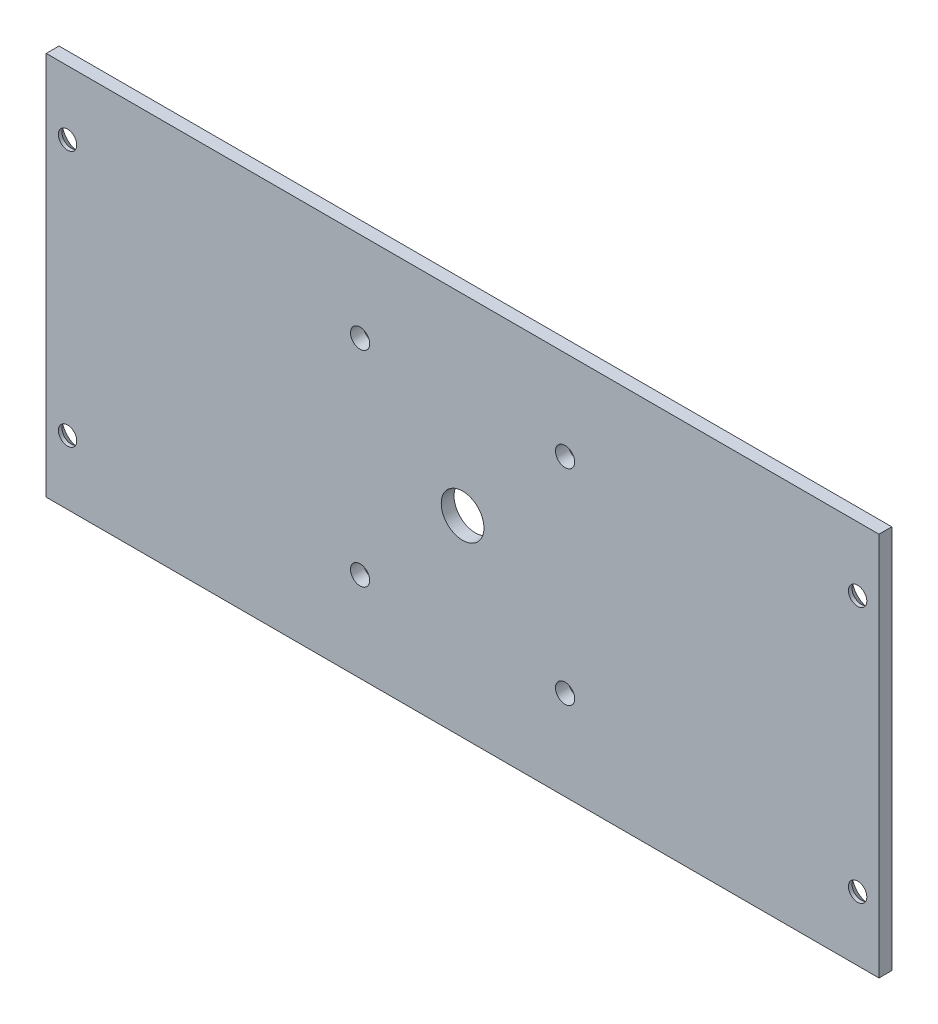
ISO-10303-21;
HEADER;
FILE_DESCRIPTION(('STEP AP214'),'2;1');
FILE_NAME('part.step','',(''),(''),'','','');
FILE_SCHEMA(('AUTOMOTIVE_DESIGN { 1 0 10303 214 1 1 1 1 }'));
ENDSEC;
DATA;
#1=APPLICATION_CONTEXT('core data for automotive mechanical design processes');
#2=APPLICATION_PROTOCOL_DEFINITION('international standard','automotive_design',2000,#1);
#3=PRODUCT_CONTEXT('',#1,'mechanical');
#4=PRODUCT('Part','Part','',(#3));
#5=PRODUCT_RELATED_PRODUCT_CATEGORY('part','',(#4));
#6=PRODUCT_DEFINITION_FORMATION('','',#4);
#7=PRODUCT_DEFINITION_CONTEXT('part definition',#1,'design');
#8=PRODUCT_DEFINITION('design','',#6,#7);
#9=PRODUCT_DEFINITION_SHAPE('','',#8);
#10=(LENGTH_UNIT() NAMED_UNIT(*) SI_UNIT(.MILLI.,.METRE.));
#11=(NAMED_UNIT(*) PLANE_ANGLE_UNIT() SI_UNIT($,.RADIAN.));
#12=(NAMED_UNIT(*) SI_UNIT($,.STERADIAN.) SOLID_ANGLE_UNIT());
#13=UNCERTAINTY_MEASURE_WITH_UNIT(LENGTH_MEASURE(1.E-05),#10,'distance_accuracy_value','');
#14=(GEOMETRIC_REPRESENTATION_CONTEXT(3) GLOBAL_UNCERTAINTY_ASSIGNED_CONTEXT((#13)) GLOBAL_UNIT_ASSIGNED_CONTEXT((#10,
#11,#12)) REPRESENTATION_CONTEXT('',''));
#15=CARTESIAN_POINT('',(0.,0.,0.));
#16=DIRECTION('',(0.,0.,1.));
#17=DIRECTION('',(1.,0.,0.));
#18=AXIS2_PLACEMENT_3D('',#15,#16,#17);
#19=CARTESIAN_POINT('',(1.15663034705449E-09,1.09956210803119E-08,3.00000001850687));
#20=DIRECTION('',(1.,0.,0.));
#21=DIRECTION('',(0.,0.,-0.999999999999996));
#22=AXIS2_PLACEMENT_3D('',#19,#20,#21);
#23=PLANE('',#22);
#24=DIRECTION('',(0.,-0.999999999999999,0.));
#25=VECTOR('',#24,1.);
#26=CARTESIAN_POINT('',(1.15640830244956E-09,1.09958986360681E-08,1.85078619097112E-08));
#27=LINE('',#26,#25);
#28=CARTESIAN_POINT('',(1.15696341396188E-09,90.000000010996,1.85089721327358E-08));
#29=VERTEX_POINT('',#28);
#30=CARTESIAN_POINT('',(1.15640830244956E-09,1.09958986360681E-08,1.85078619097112E-08));
#31=VERTEX_POINT('',#30);
#32=EDGE_CURVE('E100',#29,#31,#27,.T.);
#33=ORIENTED_EDGE('',*,*,#32,.T.);
#34=DIRECTION('',(0.,0.,-0.999999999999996));
#35=VECTOR('',#34,1.);
#36=CARTESIAN_POINT('',(1.15663034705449E-09,1.09956210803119E-08,3.00000001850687));
#37=LINE('',#36,#35);
#38=CARTESIAN_POINT('',(1.15663034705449E-09,1.09956210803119E-08,3.00000001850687));
#39=VERTEX_POINT('',#38);
#40=EDGE_CURVE('E11',#39,#31,#37,.T.);
#41=ORIENTED_EDGE('',*,*,#40,.F.);
#42=DIRECTION('',(0.,-0.999999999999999,0.));
#43=VECTOR('',#42,1.);
#44=CARTESIAN_POINT('',(1.15663034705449E-09,1.09956210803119E-08,3.00000001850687));
#45=LINE('',#44,#43);
#46=CARTESIAN_POINT('',(1.15685239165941E-09,90.0000000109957,3.00000001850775));
#47=VERTEX_POINT('',#46);
#48=EDGE_CURVE('E88',#47,#39,#45,.T.);
#49=ORIENTED_EDGE('',*,*,#48,.F.);
#50=DIRECTION('',(0.,0.,-0.999999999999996));
#51=VECTOR('',#50,1.);
#52=CARTESIAN_POINT('',(1.15685239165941E-09,90.0000000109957,3.00000001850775));
#53=LINE('',#52,#51);
#54=EDGE_CURVE('E96',#47,#29,#53,.T.);
#55=ORIENTED_EDGE('',*,*,#54,.T.);
#56=EDGE_LOOP('',(#33,#41,#49,#55));
#57=FACE_BOUND('',#56,.T.);
#58=ADVANCED_FACE('F36',(#57),#23,.F.);
#59=CARTESIAN_POINT('',(1.15663034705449E-09,1.09956210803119E-08,3.00000001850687));
#60=DIRECTION('',(0.,0.999999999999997,0.));
#61=DIRECTION('',(0.,0.,0.999999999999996));
#62=AXIS2_PLACEMENT_3D('',#59,#60,#61);
#63=PLANE('',#62);
#64=DIRECTION('',(1.,0.,0.));
#65=VECTOR('',#64,1.);
#66=CARTESIAN_POINT('',(1.15640830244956E-09,1.09958986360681E-08,1.85078619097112E-08));
#67=LINE('',#66,#65);
#68=CARTESIAN_POINT('',(195.000000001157,1.0997924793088E-08,1.85069737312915E-08));
#69=VERTEX_POINT('',#68);
#70=EDGE_CURVE('E92',#31,#69,#67,.T.);
#71=ORIENTED_EDGE('',*,*,#70,.T.);
#72=DIRECTION('',(0.,0.,-0.999999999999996));
#73=VECTOR('',#72,1.);
#74=CARTESIAN_POINT('',(195.000000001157,1.09970366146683E-08,3.00000001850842));
#75=LINE('',#74,#73);
#76=CARTESIAN_POINT('',(195.000000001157,1.09970366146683E-08,3.00000001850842));
#77=VERTEX_POINT('',#76);
#78=EDGE_CURVE('E45',#77,#69,#75,.T.);
#79=ORIENTED_EDGE('',*,*,#78,.F.);
#80=DIRECTION('',(1.,0.,0.));
#81=VECTOR('',#80,1.);
#82=CARTESIAN_POINT('',(1.15663034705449E-09,1.09956210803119E-08,3.00000001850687));
#83=LINE('',#82,#81);
#84=EDGE_CURVE('E83',#39,#77,#83,.T.);
#85=ORIENTED_EDGE('',*,*,#84,.F.);
#86=ORIENTED_EDGE('',*,*,#40,.T.);
#87=EDGE_LOOP('',(#71,#79,#85,#86));
#88=FACE_BOUND('',#87,.T.);
#89=ADVANCED_FACE('F91',(#88),#63,.F.);
#90=CARTESIAN_POINT('',(195.000000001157,1.09970366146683E-08,3.00000001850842));
#91=DIRECTION('',(-1.,0.,0.));
#92=DIRECTION('',(0.,0.,0.999999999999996));
#93=AXIS2_PLACEMENT_3D('',#90,#91,#92);
#94=PLANE('',#93);
#95=DIRECTION('',(0.,0.999999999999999,0.));
#96=VECTOR('',#95,1.);
#97=CARTESIAN_POINT('',(195.000000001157,1.0997924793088E-08,1.85069737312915E-08));
#98=LINE('',#97,#96);
#99=CARTESIAN_POINT('',(195.000000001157,90.0000000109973,1.8505641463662E-08));
#100=VERTEX_POINT('',#99);
#101=EDGE_CURVE('E70',#69,#100,#98,.T.);
#102=ORIENTED_EDGE('',*,*,#101,.T.);
#103=DIRECTION('',(0.,0.,-0.999999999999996));
#104=VECTOR('',#103,1.);
#105=CARTESIAN_POINT('',(195.000000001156,90.0000000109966,3.00000001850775));
#106=LINE('',#105,#104);
#107=CARTESIAN_POINT('',(195.000000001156,90.0000000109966,3.00000001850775));
#108=VERTEX_POINT('',#107);
#109=EDGE_CURVE('E93',#108,#100,#106,.T.);
#110=ORIENTED_EDGE('',*,*,#109,.F.);
#111=DIRECTION('',(0.,0.999999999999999,0.));
#112=VECTOR('',#111,1.);
#113=CARTESIAN_POINT('',(195.000000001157,1.09970366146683E-08,3.00000001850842));
#114=LINE('',#113,#112);
#115=EDGE_CURVE('E86',#77,#108,#114,.T.);
#116=ORIENTED_EDGE('',*,*,#115,.F.);
#117=ORIENTED_EDGE('',*,*,#78,.T.);
#118=EDGE_LOOP('',(#102,#110,#116,#117));
#119=FACE_BOUND('',#118,.T.);
#120=ADVANCED_FACE('F94',(#119),#94,.F.);
#121=CARTESIAN_POINT('',(1.15685239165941E-09,90.0000000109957,3.00000001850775));
#122=DIRECTION('',(0.,-0.999999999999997,0.));
#123=DIRECTION('',(0.,0.,-0.999999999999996));
#124=AXIS2_PLACEMENT_3D('',#121,#122,#123);
#125=PLANE('',#124);
#126=DIRECTION('',(-1.,0.,0.));
#127=VECTOR('',#126,1.);
#128=CARTESIAN_POINT('',(1.15696341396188E-09,90.000000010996,1.85089721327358E-08));
#129=LINE('',#128,#127);
#130=EDGE_CURVE('E76',#100,#29,#129,.T.);
#131=ORIENTED_EDGE('',*,*,#130,.T.);
#132=ORIENTED_EDGE('',*,*,#54,.F.);
#133=DIRECTION('',(-1.,0.,0.));
#134=VECTOR('',#133,1.);
#135=CARTESIAN_POINT('',(1.15685239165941E-09,90.0000000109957,3.00000001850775));
#136=LINE('',#135,#134);
#137=EDGE_CURVE('E53',#108,#47,#136,.T.);
#138=ORIENTED_EDGE('',*,*,#137,.F.);
#139=ORIENTED_EDGE('',*,*,#109,.T.);
#140=EDGE_LOOP('',(#131,#132,#138,#139));
#141=FACE_BOUND('',#140,.T.);
#142=ADVANCED_FACE('F108',(#141),#125,.F.);
#143=CARTESIAN_POINT('',(1.15663034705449E-09,1.09956210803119E-08,3.00000001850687));
#144=DIRECTION('',(0.,0.,-0.999999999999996));
#145=DIRECTION('',(-1.,0.,0.));
#146=AXIS2_PLACEMENT_3D('',#143,#144,#145);
#147=PLANE('',#146);
#148=CARTESIAN_POINT('',(121.500000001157,21.0000000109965,3.00000001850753));
#149=DIRECTION('',(0.,0.,-0.999999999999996));
#150=DIRECTION('',(-1.,0.,0.));
#151=AXIS2_PLACEMENT_3D('',#148,#149,#150);
#152=CIRCLE('',#151,2.25000000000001);
#153=CARTESIAN_POINT('',(119.250000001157,21.0000000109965,3.00000001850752));
#154=VERTEX_POINT('',#153);
#155=EDGE_CURVE('E153',#154,#154,#152,.T.);
#156=ORIENTED_EDGE('',*,*,#155,.T.);
#157=EDGE_LOOP('',(#156));
#158=FACE_BOUND('',#157,.T.);
#159=CARTESIAN_POINT('',(73.5000000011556,69.0000000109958,3.0000000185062));
#160=DIRECTION('',(0.,0.,-0.999999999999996));
#161=DIRECTION('',(-1.,0.,0.));
#162=AXIS2_PLACEMENT_3D('',#159,#160,#161);
#163=CIRCLE('',#162,2.25);
#164=CARTESIAN_POINT('',(71.2500000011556,69.0000000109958,3.00000001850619));
#165=VERTEX_POINT('',#164);
#166=EDGE_CURVE('E159',#165,#165,#163,.T.);
#167=ORIENTED_EDGE('',*,*,#166,.T.);
#168=EDGE_LOOP('',(#167));
#169=FACE_BOUND('',#168,.T.);
#170=CARTESIAN_POINT('',(73.5000000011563,21.0000000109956,3.00000001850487));
#171=DIRECTION('',(0.,0.,-0.999999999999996));
#172=DIRECTION('',(-1.,0.,0.));
#173=AXIS2_PLACEMENT_3D('',#170,#171,#172);
#174=CIRCLE('',#173,2.24999999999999);
#175=CARTESIAN_POINT('',(71.2500000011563,21.0000000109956,3.00000001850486));
#176=VERTEX_POINT('',#175);
#177=EDGE_CURVE('E160',#176,#176,#174,.T.);
#178=ORIENTED_EDGE('',*,*,#177,.T.);
#179=EDGE_LOOP('',(#178));
#180=FACE_BOUND('',#179,.T.);
#181=CARTESIAN_POINT('',(97.5000000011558,45.0000000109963,3.00000001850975));
#182=DIRECTION('',(0.,0.,-0.999999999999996));
#183=DIRECTION('',(-1.,0.,0.));
#184=AXIS2_PLACEMENT_3D('',#181,#182,#183);
#185=CIRCLE('',#184,5.00000000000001);
#186=CARTESIAN_POINT('',(92.5000000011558,45.0000000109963,3.00000001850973));
#187=VERTEX_POINT('',#186);
#188=EDGE_CURVE('E171',#187,#187,#185,.T.);
#189=ORIENTED_EDGE('',*,*,#188,.T.);
#190=EDGE_LOOP('',(#189));
#191=FACE_BOUND('',#190,.T.);
#192=CARTESIAN_POINT('',(121.500000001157,69.0000000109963,3.0000000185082));
#193=DIRECTION('',(0.,0.,-0.999999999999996));
#194=DIRECTION('',(-1.,0.,0.));
#195=AXIS2_PLACEMENT_3D('',#192,#193,#194);
#196=CIRCLE('',#195,2.25000000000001);
#197=CARTESIAN_POINT('',(119.250000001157,69.0000000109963,3.00000001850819));
#198=VERTEX_POINT('',#197);
#199=EDGE_CURVE('E147',#198,#198,#196,.T.);
#200=ORIENTED_EDGE('',*,*,#199,.T.);
#201=EDGE_LOOP('',(#200));
#202=FACE_BOUND('',#201,.T.);
#203=CARTESIAN_POINT('',(5.0000000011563,15.0000000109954,3.00000001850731));
#204=DIRECTION('',(0.,0.,-0.999999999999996));
#205=DIRECTION('',(-1.,0.,0.));
#206=AXIS2_PLACEMENT_3D('',#203,#204,#205);
#207=CIRCLE('',#206,2.14999999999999);
#208=CARTESIAN_POINT('',(2.85000000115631,15.0000000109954,3.0000000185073));
#209=VERTEX_POINT('',#208);
#210=EDGE_CURVE('E141',#209,#209,#207,.T.);
#211=ORIENTED_EDGE('',*,*,#210,.T.);
#212=EDGE_LOOP('',(#211));
#213=FACE_BOUND('',#212,.T.);
#214=CARTESIAN_POINT('',(5.0000000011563,75.0000000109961,3.00000001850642));
#215=DIRECTION('',(0.,0.,-0.999999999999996));
#216=DIRECTION('',(-1.,0.,0.));
#217=AXIS2_PLACEMENT_3D('',#214,#215,#216);
#218=CIRCLE('',#217,2.14999999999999);
#219=CARTESIAN_POINT('',(2.85000000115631,75.0000000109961,3.00000001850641));
#220=VERTEX_POINT('',#219);
#221=EDGE_CURVE('E135',#220,#220,#218,.T.);
#222=ORIENTED_EDGE('',*,*,#221,.T.);
#223=EDGE_LOOP('',(#222));
#224=FACE_BOUND('',#223,.T.);
#225=CARTESIAN_POINT('',(190.000000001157,15.0000000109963,3.00000001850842));
#226=DIRECTION('',(0.,0.,-0.999999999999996));
#227=DIRECTION('',(-1.,0.,0.));
#228=AXIS2_PLACEMENT_3D('',#225,#226,#227);
#229=CIRCLE('',#228,2.14999999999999);
#230=CARTESIAN_POINT('',(187.850000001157,15.0000000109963,3.00000001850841));
#231=VERTEX_POINT('',#230);
#232=EDGE_CURVE('E129',#231,#231,#229,.T.);
#233=ORIENTED_EDGE('',*,*,#232,.T.);
#234=EDGE_LOOP('',(#233));
#235=FACE_BOUND('',#234,.T.);
#236=CARTESIAN_POINT('',(190.000000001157,75.0000000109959,3.00000001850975));
#237=DIRECTION('',(0.,0.,-0.999999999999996));
#238=DIRECTION('',(-1.,0.,0.));
#239=AXIS2_PLACEMENT_3D('',#236,#237,#238);
#240=CIRCLE('',#239,2.15000000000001);
#241=CARTESIAN_POINT('',(187.850000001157,75.0000000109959,3.00000001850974));
#242=VERTEX_POINT('',#241);
#243=EDGE_CURVE('E125',#242,#242,#240,.T.);
#244=ORIENTED_EDGE('',*,*,#243,.T.);
#245=EDGE_LOOP('',(#244));
#246=FACE_BOUND('',#245,.T.);
#247=ORIENTED_EDGE('',*,*,#48,.T.);
#248=ORIENTED_EDGE('',*,*,#84,.T.);
#249=ORIENTED_EDGE('',*,*,#115,.T.);
#250=ORIENTED_EDGE('',*,*,#137,.T.);
#251=EDGE_LOOP('',(#247,#248,#249,#250));
#252=FACE_BOUND('',#251,.T.);
#253=ADVANCED_FACE('F84',(#158,#169,#180,#191,#202,#213,#224,#235,#246,#252),#147,.F.);
#254=CARTESIAN_POINT('',(1.15640830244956E-09,1.09958986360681E-08,1.85078619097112E-08));
#255=DIRECTION('',(0.,0.,-0.999999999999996));
#256=DIRECTION('',(-1.,0.,0.));
#257=AXIS2_PLACEMENT_3D('',#254,#255,#256);
#258=PLANE('',#257);
#259=CARTESIAN_POINT('',(121.500000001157,21.0000000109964,1.85080839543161E-08));
#260=DIRECTION('',(0.,0.,-0.999999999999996));
#261=DIRECTION('',(-1.,0.,0.));
#262=AXIS2_PLACEMENT_3D('',#259,#260,#261);
#263=CIRCLE('',#262,2.25000000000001);
#264=CARTESIAN_POINT('',(119.250000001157,21.0000000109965,1.85080757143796E-08));
#265=VERTEX_POINT('',#264);
#266=EDGE_CURVE('E163',#265,#265,#263,.T.);
#267=ORIENTED_EDGE('',*,*,#266,.F.);
#268=EDGE_LOOP('',(#267));
#269=FACE_BOUND('',#268,.T.);
#270=CARTESIAN_POINT('',(73.5000000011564,69.0000000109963,1.85071957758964E-08));
#271=DIRECTION('',(0.,0.,-0.999999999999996));
#272=DIRECTION('',(-1.,0.,0.));
#273=AXIS2_PLACEMENT_3D('',#270,#271,#272);
#274=CIRCLE('',#273,2.25);
#275=CARTESIAN_POINT('',(71.2500000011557,69.0000000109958,1.85071875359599E-08));
#276=VERTEX_POINT('',#275);
#277=EDGE_CURVE('E156',#276,#276,#274,.T.);
#278=ORIENTED_EDGE('',*,*,#277,.F.);
#279=EDGE_LOOP('',(#278));
#280=FACE_BOUND('',#279,.T.);
#281=CARTESIAN_POINT('',(73.5000000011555,21.0000000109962,1.8505419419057E-08));
#282=DIRECTION('',(0.,0.,-0.999999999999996));
#283=DIRECTION('',(-1.,0.,0.));
#284=AXIS2_PLACEMENT_3D('',#281,#282,#283);
#285=CIRCLE('',#284,2.24999999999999);
#286=CARTESIAN_POINT('',(71.2500000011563,21.0000000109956,1.85054111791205E-08));
#287=VERTEX_POINT('',#286);
#288=EDGE_CURVE('E174',#287,#287,#285,.T.);
#289=ORIENTED_EDGE('',*,*,#288,.F.);
#290=EDGE_LOOP('',(#289));
#291=FACE_BOUND('',#290,.T.);
#292=CARTESIAN_POINT('',(97.500000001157,45.0000000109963,1.8508528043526E-08));
#293=DIRECTION('',(0.,0.,-0.999999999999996));
#294=DIRECTION('',(-1.,0.,0.));
#295=AXIS2_PLACEMENT_3D('',#292,#293,#294);
#296=CIRCLE('',#295,5.00000000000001);
#297=CARTESIAN_POINT('',(92.5000000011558,45.0000000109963,1.85085102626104E-08));
#298=VERTEX_POINT('',#297);
#299=EDGE_CURVE('E168',#298,#298,#296,.T.);
#300=ORIENTED_EDGE('',*,*,#299,.F.);
#301=EDGE_LOOP('',(#300));
#302=FACE_BOUND('',#301,.T.);
#303=CARTESIAN_POINT('',(121.500000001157,69.0000000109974,1.85065296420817E-08));
#304=DIRECTION('',(0.,0.,-0.999999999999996));
#305=DIRECTION('',(-1.,0.,0.));
#306=AXIS2_PLACEMENT_3D('',#303,#304,#305);
#307=CIRCLE('',#306,2.25000000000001);
#308=CARTESIAN_POINT('',(119.250000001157,69.0000000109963,1.85065214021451E-08));
#309=VERTEX_POINT('',#308);
#310=EDGE_CURVE('E150',#309,#309,#307,.T.);
#311=ORIENTED_EDGE('',*,*,#310,.F.);
#312=EDGE_LOOP('',(#311));
#313=FACE_BOUND('',#312,.T.);
#314=CARTESIAN_POINT('',(190.000000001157,15.0000000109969,1.85060855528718E-08));
#315=DIRECTION('',(0.,0.,-0.999999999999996));
#316=DIRECTION('',(-1.,0.,0.));
#317=AXIS2_PLACEMENT_3D('',#314,#315,#316);
#318=CIRCLE('',#317,4.3);
#319=CARTESIAN_POINT('',(185.700000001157,15.0000000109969,1.85060705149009E-08));
#320=VERTEX_POINT('',#319);
#321=EDGE_CURVE('E116',#320,#320,#318,.T.);
#322=ORIENTED_EDGE('',*,*,#321,.F.);
#323=EDGE_LOOP('',(#322));
#324=FACE_BOUND('',#323,.T.);
#325=CARTESIAN_POINT('',(5.00000000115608,75.0000000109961,1.85076398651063E-08));
#326=DIRECTION('',(0.,0.,-0.999999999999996));
#327=DIRECTION('',(-1.,0.,0.));
#328=AXIS2_PLACEMENT_3D('',#325,#326,#327);
#329=CIRCLE('',#328,4.3);
#330=CARTESIAN_POINT('',(0.70000000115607,75.0000000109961,1.85076248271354E-08));
#331=VERTEX_POINT('',#330);
#332=EDGE_CURVE('E117',#331,#331,#329,.T.);
#333=ORIENTED_EDGE('',*,*,#332,.F.);
#334=EDGE_LOOP('',(#333));
#335=FACE_BOUND('',#334,.T.);
#336=CARTESIAN_POINT('',(5.00000000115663,15.0000000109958,1.85078619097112E-08));
#337=DIRECTION('',(0.,0.,-0.999999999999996));
#338=DIRECTION('',(-1.,0.,0.));
#339=AXIS2_PLACEMENT_3D('',#336,#337,#338);
#340=CIRCLE('',#339,4.3);
#341=CARTESIAN_POINT('',(0.700000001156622,15.0000000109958,1.85078468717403E-08));
#342=VERTEX_POINT('',#341);
#343=EDGE_CURVE('E120',#342,#342,#340,.T.);
#344=ORIENTED_EDGE('',*,*,#343,.F.);
#345=EDGE_LOOP('',(#344));
#346=FACE_BOUND('',#345,.T.);
#347=CARTESIAN_POINT('',(190.000000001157,75.0000000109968,1.85074178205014E-08));
#348=DIRECTION('',(0.,0.,-0.999999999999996));
#349=DIRECTION('',(-1.,0.,0.));
#350=AXIS2_PLACEMENT_3D('',#347,#348,#349);
#351=CIRCLE('',#350,4.3);
#352=CARTESIAN_POINT('',(185.700000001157,75.0000000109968,1.85074027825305E-08));
#353=VERTEX_POINT('',#352);
#354=EDGE_CURVE('E103',#353,#353,#351,.T.);
#355=ORIENTED_EDGE('',*,*,#354,.F.);
#356=EDGE_LOOP('',(#355));
#357=FACE_BOUND('',#356,.T.);
#358=ORIENTED_EDGE('',*,*,#32,.F.);
#359=ORIENTED_EDGE('',*,*,#130,.F.);
#360=ORIENTED_EDGE('',*,*,#101,.F.);
#361=ORIENTED_EDGE('',*,*,#70,.F.);
#362=EDGE_LOOP('',(#358,#359,#360,#361));
#363=FACE_BOUND('',#362,.T.);
#364=ADVANCED_FACE('F111',(#269,#280,#291,#302,#313,#324,#335,#346,#357,#363),#258,.T.);
#365=CARTESIAN_POINT('',(190.000000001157,75.0000000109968,1.85074178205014E-08));
#366=DIRECTION('',(0.,0.,-0.999999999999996));
#367=DIRECTION('',(-1.,0.,0.));
#368=AXIS2_PLACEMENT_3D('',#365,#366,#367);
#369=CONICAL_SURFACE('',#368,4.3,0.78539816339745);
#370=CARTESIAN_POINT('',(190.000000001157,75.0000000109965,2.1500000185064));
#371=DIRECTION('',(0.,0.,-0.999999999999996));
#372=DIRECTION('',(-1.,0.,0.));
#373=AXIS2_PLACEMENT_3D('',#370,#371,#372);
#374=CIRCLE('',#373,2.15000000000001);
#375=CARTESIAN_POINT('',(187.850000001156,75.0000000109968,2.1500000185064));
#376=VERTEX_POINT('',#375);
#377=EDGE_CURVE('E126',#376,#376,#374,.T.);
#378=CARTESIAN_POINT('',(187.850000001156,75.0000000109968,2.1500000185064));
#379=CARTESIAN_POINT('',(187.827604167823,75.0000000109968,2.12760418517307));
#380=CARTESIAN_POINT('',(187.805208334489,75.0000000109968,2.10520835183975));
#381=CARTESIAN_POINT('',(187.760416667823,75.0000000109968,2.0604166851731));
#382=CARTESIAN_POINT('',(187.73802083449,75.0000000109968,2.03802085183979));
#383=CARTESIAN_POINT('',(187.693229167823,75.0000000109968,1.99322918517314));
#384=CARTESIAN_POINT('',(187.67083333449,75.0000000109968,1.97083335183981));
#385=CARTESIAN_POINT('',(187.626041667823,75.0000000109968,1.92604168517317));
#386=CARTESIAN_POINT('',(187.60364583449,75.0000000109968,1.90364585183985));
#387=CARTESIAN_POINT('',(187.558854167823,75.0000000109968,1.8588541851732));
#388=CARTESIAN_POINT('',(187.53645833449,75.0000000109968,1.83645835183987));
#389=CARTESIAN_POINT('',(187.491666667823,75.0000000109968,1.79166668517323));
#390=CARTESIAN_POINT('',(187.46927083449,75.0000000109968,1.76927085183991));
#391=CARTESIAN_POINT('',(187.424479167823,75.0000000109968,1.72447918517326));
#392=CARTESIAN_POINT('',(187.40208333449,75.0000000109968,1.70208335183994));
#393=CARTESIAN_POINT('',(187.357291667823,75.0000000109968,1.65729168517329));
#394=CARTESIAN_POINT('',(187.33489583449,75.0000000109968,1.63489585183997));
#395=CARTESIAN_POINT('',(187.290104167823,75.0000000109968,1.59010418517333));
#396=CARTESIAN_POINT('',(187.26770833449,75.0000000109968,1.56770835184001));
#397=CARTESIAN_POINT('',(187.222916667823,75.0000000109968,1.52291668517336));
#398=CARTESIAN_POINT('',(187.20052083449,75.0000000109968,1.50052085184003));
#399=CARTESIAN_POINT('',(187.155729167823,75.0000000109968,1.45572918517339));
#400=CARTESIAN_POINT('',(187.13333333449,75.0000000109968,1.43333335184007));
#401=CARTESIAN_POINT('',(187.088541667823,75.0000000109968,1.38854168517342));
#402=CARTESIAN_POINT('',(187.06614583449,75.0000000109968,1.36614585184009));
#403=CARTESIAN_POINT('',(187.021354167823,75.0000000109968,1.32135418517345));
#404=CARTESIAN_POINT('',(186.99895833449,75.0000000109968,1.29895835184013));
#405=CARTESIAN_POINT('',(186.954166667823,75.0000000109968,1.25416668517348));
#406=CARTESIAN_POINT('',(186.93177083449,75.0000000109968,1.23177085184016));
#407=CARTESIAN_POINT('',(186.886979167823,75.0000000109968,1.18697918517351));
#408=CARTESIAN_POINT('',(186.86458333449,75.0000000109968,1.16458335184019));
#409=CARTESIAN_POINT('',(186.819791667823,75.0000000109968,1.11979168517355));
#410=CARTESIAN_POINT('',(186.79739583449,75.0000000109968,1.09739585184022));
#411=CARTESIAN_POINT('',(186.752604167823,75.0000000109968,1.05260418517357));
#412=CARTESIAN_POINT('',(186.73020833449,75.0000000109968,1.03020835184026));
#413=CARTESIAN_POINT('',(186.685416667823,75.0000000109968,0.985416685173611));
#414=CARTESIAN_POINT('',(186.66302083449,75.0000000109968,0.963020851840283));
#415=CARTESIAN_POINT('',(186.618229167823,75.0000000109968,0.918229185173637));
#416=CARTESIAN_POINT('',(186.59583333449,75.0000000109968,0.895833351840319));
#417=CARTESIAN_POINT('',(186.551041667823,75.0000000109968,0.851041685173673));
#418=CARTESIAN_POINT('',(186.52864583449,75.0000000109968,0.828645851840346));
#419=CARTESIAN_POINT('',(186.483854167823,75.0000000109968,0.7838541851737));
#420=CARTESIAN_POINT('',(186.46145833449,75.0000000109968,0.761458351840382));
#421=CARTESIAN_POINT('',(186.416666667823,75.0000000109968,0.716666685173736));
#422=CARTESIAN_POINT('',(186.39427083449,75.0000000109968,0.694270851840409));
#423=CARTESIAN_POINT('',(186.349479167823,75.0000000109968,0.649479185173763));
#424=CARTESIAN_POINT('',(186.32708333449,75.0000000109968,0.627083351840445));
#425=CARTESIAN_POINT('',(186.282291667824,75.0000000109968,0.582291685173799));
#426=CARTESIAN_POINT('',(186.25989583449,75.0000000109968,0.559895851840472));
#427=CARTESIAN_POINT('',(186.215104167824,75.0000000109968,0.515104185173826));
#428=CARTESIAN_POINT('',(186.19270833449,75.0000000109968,0.492708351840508));
#429=CARTESIAN_POINT('',(186.147916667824,75.0000000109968,0.447916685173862));
#430=CARTESIAN_POINT('',(186.12552083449,75.0000000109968,0.425520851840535));
#431=CARTESIAN_POINT('',(186.080729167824,75.0000000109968,0.380729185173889));
#432=CARTESIAN_POINT('',(186.05833333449,75.0000000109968,0.358333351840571));
#433=CARTESIAN_POINT('',(186.013541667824,75.0000000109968,0.313541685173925));
#434=CARTESIAN_POINT('',(185.99114583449,75.0000000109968,0.291145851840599));
#435=CARTESIAN_POINT('',(185.946354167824,75.0000000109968,0.246354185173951));
#436=CARTESIAN_POINT('',(185.92395833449,75.0000000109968,0.22395835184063));
#437=CARTESIAN_POINT('',(185.879166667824,75.0000000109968,0.179166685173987));
#438=CARTESIAN_POINT('',(185.85677083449,75.0000000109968,0.156770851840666));
#439=CARTESIAN_POINT('',(185.811979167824,75.0000000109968,0.111979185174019));
#440=CARTESIAN_POINT('',(185.78958333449,75.0000000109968,0.0895833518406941));
#441=CARTESIAN_POINT('',(185.744791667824,75.0000000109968,0.0447916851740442));
#442=CARTESIAN_POINT('',(185.72239583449,75.0000000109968,0.0223958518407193));
#443=CARTESIAN_POINT('',(185.700000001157,75.0000000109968,1.85074029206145E-08));
#444=B_SPLINE_CURVE_WITH_KNOTS('',3,(#378,#379,#380,#381,#382,#383,#384,#385,#386,#387,#388,
#389,#390,#391,#392,#393,#394,#395,#396,#397,#398,#399,#400,#401,#402,#403,#404,#405,#406,#407,
#408,#409,#410,#411,#412,#413,#414,#415,#416,#417,#418,#419,#420,#421,#422,#423,#424,#425,#426,
#427,#428,#429,#430,#431,#432,#433,#434,#435,#436,#437,#438,#439,#440,#441,#442,#443),
.UNSPECIFIED.,.F.,.F.,(4,2,2,2,2,2,2,2,2,2,2,2,2,2,2,2,2,2,2,2,2,2,2,2,2,2,2,2,2,2,2,2,4),(0.,
0.0950174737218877,0.190034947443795,0.285052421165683,0.380069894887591,0.475087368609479,
0.570104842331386,0.665122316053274,0.760139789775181,0.855157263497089,0.950174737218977,
1.04519221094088,1.14020968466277,1.23522715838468,1.33024463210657,1.42526210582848,
1.52027957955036,1.61529705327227,1.71031452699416,1.80533200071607,1.90034947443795,
1.99536694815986,2.09038442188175,2.18540189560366,2.28041936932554,2.37543684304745,
2.47045431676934,2.56547179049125,2.66048926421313,2.75550673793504,2.85052421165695,
2.94554168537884,3.04055915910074),.UNSPECIFIED.);
#445=EDGE_CURVE('BSEAM38',#376,#353,#444,.T.);
#446=ORIENTED_EDGE('',*,*,#377,.F.);
#447=ORIENTED_EDGE('',*,*,#354,.T.);
#448=ORIENTED_EDGE('',*,*,#445,.T.);
#449=ORIENTED_EDGE('',*,*,#445,.F.);
#450=EDGE_LOOP('',(#446,#448,#447,#449));
#451=FACE_BOUND('',#450,.T.);
#452=ADVANCED_FACE('F38',(#451),#369,.F.);
#453=CARTESIAN_POINT('',(5.00000000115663,15.0000000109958,1.85078619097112E-08));
#454=DIRECTION('',(0.,0.,-0.999999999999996));
#455=DIRECTION('',(-1.,0.,0.));
#456=AXIS2_PLACEMENT_3D('',#453,#454,#455);
#457=CONICAL_SURFACE('',#456,4.3,0.78539816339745);
#458=CARTESIAN_POINT('',(5.00000000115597,15.0000000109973,2.15000001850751));
#459=DIRECTION('',(0.,0.,-0.999999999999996));
#460=DIRECTION('',(-1.,0.,0.));
#461=AXIS2_PLACEMENT_3D('',#458,#459,#460);
#462=CIRCLE('',#461,2.14999999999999);
#463=CARTESIAN_POINT('',(2.85000000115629,15.0000000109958,2.15000001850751));
#464=VERTEX_POINT('',#463);
#465=EDGE_CURVE('E144',#464,#464,#462,.T.);
#466=CARTESIAN_POINT('',(2.85000000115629,15.0000000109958,2.15000001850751));
#467=CARTESIAN_POINT('',(2.82760416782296,15.0000000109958,2.12760418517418));
#468=CARTESIAN_POINT('',(2.80520833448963,15.0000000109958,2.10520835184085));
#469=CARTESIAN_POINT('',(2.76041666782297,15.0000000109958,2.06041668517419));
#470=CARTESIAN_POINT('',(2.73802083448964,15.0000000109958,2.03802085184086));
#471=CARTESIAN_POINT('',(2.69322916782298,15.0000000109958,1.9932291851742));
#472=CARTESIAN_POINT('',(2.67083333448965,15.0000000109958,1.97083335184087));
#473=CARTESIAN_POINT('',(2.62604166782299,15.0000000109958,1.92604168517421));
#474=CARTESIAN_POINT('',(2.60364583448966,15.0000000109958,1.90364585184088));
#475=CARTESIAN_POINT('',(2.558854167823,15.0000000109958,1.85885418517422));
#476=CARTESIAN_POINT('',(2.53645833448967,15.0000000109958,1.83645835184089));
#477=CARTESIAN_POINT('',(2.49166666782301,15.0000000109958,1.79166668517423));
#478=CARTESIAN_POINT('',(2.46927083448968,15.0000000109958,1.7692708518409));
#479=CARTESIAN_POINT('',(2.42447916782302,15.0000000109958,1.72447918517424));
#480=CARTESIAN_POINT('',(2.40208333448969,15.0000000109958,1.70208335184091));
#481=CARTESIAN_POINT('',(2.35729166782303,15.0000000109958,1.65729168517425));
#482=CARTESIAN_POINT('',(2.3348958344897,15.0000000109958,1.63489585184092));
#483=CARTESIAN_POINT('',(2.29010416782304,15.0000000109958,1.59010418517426));
#484=CARTESIAN_POINT('',(2.26770833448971,15.0000000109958,1.56770835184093));
#485=CARTESIAN_POINT('',(2.22291666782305,15.0000000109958,1.52291668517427));
#486=CARTESIAN_POINT('',(2.20052083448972,15.0000000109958,1.50052085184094));
#487=CARTESIAN_POINT('',(2.15572916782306,15.0000000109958,1.45572918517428));
#488=CARTESIAN_POINT('',(2.13333333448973,15.0000000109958,1.43333335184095));
#489=CARTESIAN_POINT('',(2.08854166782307,15.0000000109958,1.38854168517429));
#490=CARTESIAN_POINT('',(2.06614583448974,15.0000000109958,1.36614585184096));
#491=CARTESIAN_POINT('',(2.02135416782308,15.0000000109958,1.3213541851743));
#492=CARTESIAN_POINT('',(1.99895833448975,15.0000000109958,1.29895835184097));
#493=CARTESIAN_POINT('',(1.95416666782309,15.0000000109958,1.25416668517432));
#494=CARTESIAN_POINT('',(1.93177083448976,15.0000000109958,1.23177085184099));
#495=CARTESIAN_POINT('',(1.8869791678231,15.0000000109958,1.18697918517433));
#496=CARTESIAN_POINT('',(1.86458333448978,15.0000000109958,1.164583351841));
#497=CARTESIAN_POINT('',(1.81979166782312,15.0000000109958,1.11979168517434));
#498=CARTESIAN_POINT('',(1.79739583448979,15.0000000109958,1.09739585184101));
#499=CARTESIAN_POINT('',(1.75260416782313,15.0000000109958,1.05260418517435));
#500=CARTESIAN_POINT('',(1.7302083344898,15.0000000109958,1.03020835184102));
#501=CARTESIAN_POINT('',(1.68541666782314,15.0000000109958,0.985416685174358));
#502=CARTESIAN_POINT('',(1.66302083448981,15.0000000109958,0.963020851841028));
#503=CARTESIAN_POINT('',(1.61822916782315,15.0000000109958,0.918229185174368));
#504=CARTESIAN_POINT('',(1.59583333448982,15.0000000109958,0.895833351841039));
#505=CARTESIAN_POINT('',(1.55104166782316,15.0000000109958,0.851041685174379));
#506=CARTESIAN_POINT('',(1.52864583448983,15.0000000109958,0.828645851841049));
#507=CARTESIAN_POINT('',(1.48385416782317,15.0000000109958,0.78385418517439));
#508=CARTESIAN_POINT('',(1.46145833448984,15.0000000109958,0.76145835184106));
#509=CARTESIAN_POINT('',(1.41666666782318,15.0000000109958,0.7166666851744));
#510=CARTESIAN_POINT('',(1.39427083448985,15.0000000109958,0.69427085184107));
#511=CARTESIAN_POINT('',(1.34947916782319,15.0000000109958,0.649479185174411));
#512=CARTESIAN_POINT('',(1.32708333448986,15.0000000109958,0.627083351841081));
#513=CARTESIAN_POINT('',(1.2822916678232,15.0000000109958,0.582291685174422));
#514=CARTESIAN_POINT('',(1.25989583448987,15.0000000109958,0.559895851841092));
#515=CARTESIAN_POINT('',(1.21510416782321,15.0000000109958,0.515104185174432));
#516=CARTESIAN_POINT('',(1.19270833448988,15.0000000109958,0.492708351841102));
#517=CARTESIAN_POINT('',(1.14791666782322,15.0000000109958,0.447916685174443));
#518=CARTESIAN_POINT('',(1.12552083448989,15.0000000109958,0.425520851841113));
#519=CARTESIAN_POINT('',(1.08072916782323,15.0000000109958,0.380729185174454));
#520=CARTESIAN_POINT('',(1.0583333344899,15.0000000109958,0.358333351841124));
#521=CARTESIAN_POINT('',(1.01354166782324,15.0000000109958,0.313541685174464));
#522=CARTESIAN_POINT('',(0.99114583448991,15.0000000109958,0.291145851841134));
#523=CARTESIAN_POINT('',(0.946354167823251,15.0000000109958,0.246354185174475));
#524=CARTESIAN_POINT('',(0.923958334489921,15.0000000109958,0.223958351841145));
#525=CARTESIAN_POINT('',(0.879166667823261,15.0000000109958,0.179166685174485));
#526=CARTESIAN_POINT('',(0.856770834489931,15.0000000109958,0.156770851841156));
#527=CARTESIAN_POINT('',(0.811979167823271,15.0000000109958,0.111979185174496));
#528=CARTESIAN_POINT('',(0.789583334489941,15.0000000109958,0.0895833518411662));
#529=CARTESIAN_POINT('',(0.744791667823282,15.0000000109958,0.0447916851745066));
#530=CARTESIAN_POINT('',(0.722395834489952,15.0000000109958,0.0223958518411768));
#531=CARTESIAN_POINT('',(0.700000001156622,15.0000000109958,1.85078470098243E-08));
#532=B_SPLINE_CURVE_WITH_KNOTS('',3,(#466,#467,#468,#469,#470,#471,#472,#473,#474,#475,#476,
#477,#478,#479,#480,#481,#482,#483,#484,#485,#486,#487,#488,#489,#490,#491,#492,#493,#494,#495,
#496,#497,#498,#499,#500,#501,#502,#503,#504,#505,#506,#507,#508,#509,#510,#511,#512,#513,#514,
#515,#516,#517,#518,#519,#520,#521,#522,#523,#524,#525,#526,#527,#528,#529,#530,#531),
.UNSPECIFIED.,.F.,.F.,(4,2,2,2,2,2,2,2,2,2,2,2,2,2,2,2,2,2,2,2,2,2,2,2,2,2,2,2,2,2,2,2,4),(0.,
0.0950174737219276,0.190034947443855,0.285052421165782,0.38006989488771,0.475087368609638,
0.570104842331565,0.665122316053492,0.76013978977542,0.855157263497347,0.950174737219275,
1.0451922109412,1.14020968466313,1.23522715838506,1.33024463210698,1.42526210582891,
1.52027957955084,1.61529705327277,1.71031452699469,1.80533200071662,1.90034947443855,
1.99536694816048,2.0903844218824,2.18540189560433,2.28041936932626,2.37543684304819,
2.47045431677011,2.56547179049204,2.66048926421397,2.7555067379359,2.85052421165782,
2.94554168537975,3.04055915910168),.UNSPECIFIED.);
#533=EDGE_CURVE('BSEAM207',#464,#342,#532,.T.);
#534=ORIENTED_EDGE('',*,*,#465,.F.);
#535=ORIENTED_EDGE('',*,*,#343,.T.);
#536=ORIENTED_EDGE('',*,*,#533,.T.);
#537=ORIENTED_EDGE('',*,*,#533,.F.);
#538=EDGE_LOOP('',(#534,#536,#535,#537));
#539=FACE_BOUND('',#538,.T.);
#540=ADVANCED_FACE('F207',(#539),#457,.F.);
#541=CARTESIAN_POINT('',(5.00000000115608,75.0000000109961,1.85076398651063E-08));
#542=DIRECTION('',(0.,0.,-0.999999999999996));
#543=DIRECTION('',(-1.,0.,0.));
#544=AXIS2_PLACEMENT_3D('',#541,#542,#543);
#545=CONICAL_SURFACE('',#544,4.3,0.78539816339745);
#546=CARTESIAN_POINT('',(5.00000000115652,75.0000000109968,2.15000001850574));
#547=DIRECTION('',(0.,0.,-0.999999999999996));
#548=DIRECTION('',(-1.,0.,0.));
#549=AXIS2_PLACEMENT_3D('',#546,#547,#548);
#550=CIRCLE('',#549,2.14999999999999);
#551=CARTESIAN_POINT('',(2.85000000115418,75.0000000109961,2.15000001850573));
#552=VERTEX_POINT('',#551);
#553=EDGE_CURVE('E138',#552,#552,#550,.T.);
#554=CARTESIAN_POINT('',(2.85000000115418,75.0000000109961,2.15000001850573));
#555=CARTESIAN_POINT('',(2.82760416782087,75.0000000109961,2.12760418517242));
#556=CARTESIAN_POINT('',(2.80520833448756,75.0000000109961,2.1052083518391));
#557=CARTESIAN_POINT('',(2.76041666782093,75.0000000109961,2.06041668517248));
#558=CARTESIAN_POINT('',(2.73802083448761,75.0000000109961,2.03802085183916));
#559=CARTESIAN_POINT('',(2.69322916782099,75.0000000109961,1.99322918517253));
#560=CARTESIAN_POINT('',(2.67083333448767,75.0000000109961,1.97083335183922));
#561=CARTESIAN_POINT('',(2.62604166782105,75.0000000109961,1.92604168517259));
#562=CARTESIAN_POINT('',(2.60364583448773,75.0000000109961,1.90364585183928));
#563=CARTESIAN_POINT('',(2.55885416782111,75.0000000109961,1.85885418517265));
#564=CARTESIAN_POINT('',(2.53645833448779,75.0000000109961,1.83645835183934));
#565=CARTESIAN_POINT('',(2.49166666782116,75.0000000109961,1.79166668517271));
#566=CARTESIAN_POINT('',(2.46927083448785,75.0000000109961,1.7692708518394));
#567=CARTESIAN_POINT('',(2.42447916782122,75.0000000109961,1.72447918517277));
#568=CARTESIAN_POINT('',(2.40208333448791,75.0000000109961,1.70208335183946));
#569=CARTESIAN_POINT('',(2.35729166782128,75.0000000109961,1.65729168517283));
#570=CARTESIAN_POINT('',(2.33489583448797,75.0000000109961,1.63489585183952));
#571=CARTESIAN_POINT('',(2.29010416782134,75.0000000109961,1.59010418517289));
#572=CARTESIAN_POINT('',(2.26770833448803,75.0000000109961,1.56770835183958));
#573=CARTESIAN_POINT('',(2.2229166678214,75.0000000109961,1.52291668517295));
#574=CARTESIAN_POINT('',(2.20052083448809,75.0000000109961,1.50052085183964));
#575=CARTESIAN_POINT('',(2.15572916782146,75.0000000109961,1.45572918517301));
#576=CARTESIAN_POINT('',(2.13333333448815,75.0000000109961,1.43333335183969));
#577=CARTESIAN_POINT('',(2.08854166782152,75.0000000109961,1.38854168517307));
#578=CARTESIAN_POINT('',(2.0661458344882,75.0000000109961,1.36614585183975));
#579=CARTESIAN_POINT('',(2.02135416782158,75.0000000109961,1.32135418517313));
#580=CARTESIAN_POINT('',(1.99895833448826,75.0000000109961,1.29895835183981));
#581=CARTESIAN_POINT('',(1.95416666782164,75.0000000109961,1.25416668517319));
#582=CARTESIAN_POINT('',(1.93177083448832,75.0000000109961,1.23177085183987));
#583=CARTESIAN_POINT('',(1.88697916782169,75.0000000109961,1.18697918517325));
#584=CARTESIAN_POINT('',(1.86458333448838,75.0000000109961,1.16458335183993));
#585=CARTESIAN_POINT('',(1.81979166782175,75.0000000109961,1.1197916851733));
#586=CARTESIAN_POINT('',(1.79739583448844,75.0000000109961,1.09739585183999));
#587=CARTESIAN_POINT('',(1.75260416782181,75.0000000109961,1.05260418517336));
#588=CARTESIAN_POINT('',(1.7302083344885,75.0000000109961,1.03020835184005));
#589=CARTESIAN_POINT('',(1.68541666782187,75.0000000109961,0.985416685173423));
#590=CARTESIAN_POINT('',(1.66302083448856,75.0000000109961,0.96302085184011));
#591=CARTESIAN_POINT('',(1.61822916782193,75.0000000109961,0.918229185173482));
#592=CARTESIAN_POINT('',(1.59583333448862,75.0000000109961,0.895833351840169));
#593=CARTESIAN_POINT('',(1.55104166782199,75.0000000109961,0.851041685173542));
#594=CARTESIAN_POINT('',(1.52864583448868,75.0000000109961,0.828645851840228));
#595=CARTESIAN_POINT('',(1.48385416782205,75.0000000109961,0.783854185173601));
#596=CARTESIAN_POINT('',(1.46145833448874,75.0000000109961,0.761458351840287));
#597=CARTESIAN_POINT('',(1.41666666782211,75.0000000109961,0.71666668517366));
#598=CARTESIAN_POINT('',(1.39427083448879,75.0000000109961,0.694270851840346));
#599=CARTESIAN_POINT('',(1.34947916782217,75.0000000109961,0.649479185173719));
#600=CARTESIAN_POINT('',(1.32708333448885,75.0000000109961,0.627083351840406));
#601=CARTESIAN_POINT('',(1.28229166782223,75.0000000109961,0.582291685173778));
#602=CARTESIAN_POINT('',(1.25989583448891,75.0000000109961,0.559895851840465));
#603=CARTESIAN_POINT('',(1.21510416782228,75.0000000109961,0.515104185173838));
#604=CARTESIAN_POINT('',(1.19270833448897,75.0000000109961,0.492708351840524));
#605=CARTESIAN_POINT('',(1.14791666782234,75.0000000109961,0.447916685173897));
#606=CARTESIAN_POINT('',(1.12552083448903,75.0000000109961,0.425520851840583));
#607=CARTESIAN_POINT('',(1.0807291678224,75.0000000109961,0.380729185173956));
#608=CARTESIAN_POINT('',(1.05833333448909,75.0000000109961,0.358333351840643));
#609=CARTESIAN_POINT('',(1.01354166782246,75.0000000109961,0.313541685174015));
#610=CARTESIAN_POINT('',(0.991145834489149,75.0000000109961,0.291145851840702));
#611=CARTESIAN_POINT('',(0.946354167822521,75.0000000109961,0.246354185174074));
#612=CARTESIAN_POINT('',(0.923958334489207,75.0000000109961,0.223958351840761));
#613=CARTESIAN_POINT('',(0.87916666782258,75.0000000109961,0.179166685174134));
#614=CARTESIAN_POINT('',(0.856770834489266,75.0000000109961,0.15677085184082));
#615=CARTESIAN_POINT('',(0.811979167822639,75.0000000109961,0.111979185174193));
#616=CARTESIAN_POINT('',(0.789583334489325,75.0000000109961,0.0895833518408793));
#617=CARTESIAN_POINT('',(0.744791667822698,75.0000000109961,0.0447916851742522));
#618=CARTESIAN_POINT('',(0.722395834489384,75.0000000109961,0.0223958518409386));
#619=CARTESIAN_POINT('',(0.70000000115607,75.0000000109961,1.85076249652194E-08));
#620=B_SPLINE_CURVE_WITH_KNOTS('',3,(#554,#555,#556,#557,#558,#559,#560,#561,#562,#563,#564,
#565,#566,#567,#568,#569,#570,#571,#572,#573,#574,#575,#576,#577,#578,#579,#580,#581,#582,#583,
#584,#585,#586,#587,#588,#589,#590,#591,#592,#593,#594,#595,#596,#597,#598,#599,#600,#601,#602,
#603,#604,#605,#606,#607,#608,#609,#610,#611,#612,#613,#614,#615,#616,#617,#618,#619),
.UNSPECIFIED.,.F.,.F.,(4,2,2,2,2,2,2,2,2,2,2,2,2,2,2,2,2,2,2,2,2,2,2,2,2,2,2,2,2,2,2,2,4),(0.,
0.0950174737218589,0.190034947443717,0.285052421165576,0.380069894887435,0.475087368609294,
0.570104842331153,0.665122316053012,0.760139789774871,0.855157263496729,0.950174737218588,
1.04519221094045,1.1402096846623,1.23522715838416,1.33024463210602,1.42526210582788,
1.52027957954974,1.6152970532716,1.71031452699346,1.80533200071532,1.90034947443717,
1.99536694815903,2.09038442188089,2.18540189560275,2.28041936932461,2.37543684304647,
2.47045431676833,2.56547179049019,2.66048926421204,2.7555067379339,2.85052421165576,
2.94554168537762,3.04055915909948),.UNSPECIFIED.);
#621=EDGE_CURVE('BSEAM212',#552,#331,#620,.T.);
#622=ORIENTED_EDGE('',*,*,#553,.F.);
#623=ORIENTED_EDGE('',*,*,#332,.T.);
#624=ORIENTED_EDGE('',*,*,#621,.T.);
#625=ORIENTED_EDGE('',*,*,#621,.F.);
#626=EDGE_LOOP('',(#622,#624,#623,#625));
#627=FACE_BOUND('',#626,.T.);
#628=ADVANCED_FACE('F212',(#627),#545,.F.);
#629=CARTESIAN_POINT('',(190.000000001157,15.0000000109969,1.85060855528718E-08));
#630=DIRECTION('',(0.,0.,-0.999999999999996));
#631=DIRECTION('',(-1.,0.,0.));
#632=AXIS2_PLACEMENT_3D('',#629,#630,#631);
#633=CONICAL_SURFACE('',#632,4.3,0.78539816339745);
#634=CARTESIAN_POINT('',(190.000000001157,15.0000000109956,2.15000001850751));
#635=DIRECTION('',(0.,0.,-0.999999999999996));
#636=DIRECTION('',(-1.,0.,0.));
#637=AXIS2_PLACEMENT_3D('',#634,#635,#636);
#638=CIRCLE('',#637,2.14999999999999);
#639=CARTESIAN_POINT('',(187.850000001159,15.0000000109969,2.15000001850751));
#640=VERTEX_POINT('',#639);
#641=EDGE_CURVE('E132',#640,#640,#638,.T.);
#642=CARTESIAN_POINT('',(187.850000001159,15.0000000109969,2.15000001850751));
#643=CARTESIAN_POINT('',(187.827604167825,15.0000000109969,2.12760418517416));
#644=CARTESIAN_POINT('',(187.805208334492,15.0000000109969,2.10520835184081));
#645=CARTESIAN_POINT('',(187.760416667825,15.0000000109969,2.06041668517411));
#646=CARTESIAN_POINT('',(187.738020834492,15.0000000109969,2.03802085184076));
#647=CARTESIAN_POINT('',(187.693229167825,15.0000000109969,1.99322918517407));
#648=CARTESIAN_POINT('',(187.670833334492,15.0000000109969,1.97083335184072));
#649=CARTESIAN_POINT('',(187.626041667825,15.0000000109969,1.92604168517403));
#650=CARTESIAN_POINT('',(187.603645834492,15.0000000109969,1.90364585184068));
#651=CARTESIAN_POINT('',(187.558854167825,15.0000000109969,1.85885418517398));
#652=CARTESIAN_POINT('',(187.536458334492,15.0000000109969,1.83645835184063));
#653=CARTESIAN_POINT('',(187.491666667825,15.0000000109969,1.79166668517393));
#654=CARTESIAN_POINT('',(187.469270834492,15.0000000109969,1.76927085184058));
#655=CARTESIAN_POINT('',(187.424479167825,15.0000000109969,1.72447918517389));
#656=CARTESIAN_POINT('',(187.402083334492,15.0000000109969,1.70208335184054));
#657=CARTESIAN_POINT('',(187.357291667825,15.0000000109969,1.65729168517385));
#658=CARTESIAN_POINT('',(187.334895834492,15.0000000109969,1.6348958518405));
#659=CARTESIAN_POINT('',(187.290104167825,15.0000000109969,1.5901041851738));
#660=CARTESIAN_POINT('',(187.267708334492,15.0000000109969,1.56770835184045));
#661=CARTESIAN_POINT('',(187.222916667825,15.0000000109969,1.52291668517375));
#662=CARTESIAN_POINT('',(187.200520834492,15.0000000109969,1.50052085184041));
#663=CARTESIAN_POINT('',(187.155729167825,15.0000000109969,1.45572918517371));
#664=CARTESIAN_POINT('',(187.133333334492,15.0000000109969,1.43333335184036));
#665=CARTESIAN_POINT('',(187.088541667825,15.0000000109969,1.38854168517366));
#666=CARTESIAN_POINT('',(187.066145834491,15.0000000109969,1.36614585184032));
#667=CARTESIAN_POINT('',(187.021354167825,15.0000000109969,1.32135418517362));
#668=CARTESIAN_POINT('',(186.998958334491,15.0000000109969,1.29895835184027));
#669=CARTESIAN_POINT('',(186.954166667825,15.0000000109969,1.25416668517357));
#670=CARTESIAN_POINT('',(186.931770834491,15.0000000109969,1.23177085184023));
#671=CARTESIAN_POINT('',(186.886979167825,15.0000000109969,1.18697918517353));
#672=CARTESIAN_POINT('',(186.864583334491,15.0000000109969,1.16458335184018));
#673=CARTESIAN_POINT('',(186.819791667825,15.0000000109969,1.11979168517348));
#674=CARTESIAN_POINT('',(186.797395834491,15.0000000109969,1.09739585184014));
#675=CARTESIAN_POINT('',(186.752604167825,15.0000000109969,1.05260418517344));
#676=CARTESIAN_POINT('',(186.730208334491,15.0000000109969,1.03020835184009));
#677=CARTESIAN_POINT('',(186.685416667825,15.0000000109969,0.985416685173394));
#678=CARTESIAN_POINT('',(186.663020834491,15.0000000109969,0.963020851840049));
#679=CARTESIAN_POINT('',(186.618229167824,15.0000000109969,0.918229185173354));
#680=CARTESIAN_POINT('',(186.595833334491,15.0000000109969,0.895833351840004));
#681=CARTESIAN_POINT('',(186.551041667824,15.0000000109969,0.851041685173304));
#682=CARTESIAN_POINT('',(186.528645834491,15.0000000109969,0.828645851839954));
#683=CARTESIAN_POINT('',(186.483854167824,15.0000000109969,0.783854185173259));
#684=CARTESIAN_POINT('',(186.461458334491,15.0000000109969,0.761458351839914));
#685=CARTESIAN_POINT('',(186.416666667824,15.0000000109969,0.716666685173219));
#686=CARTESIAN_POINT('',(186.394270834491,15.0000000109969,0.694270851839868));
#687=CARTESIAN_POINT('',(186.349479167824,15.0000000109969,0.64947918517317));
#688=CARTESIAN_POINT('',(186.327083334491,15.0000000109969,0.627083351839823));
#689=CARTESIAN_POINT('',(186.282291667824,15.0000000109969,0.582291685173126));
#690=CARTESIAN_POINT('',(186.259895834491,15.0000000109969,0.559895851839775));
#691=CARTESIAN_POINT('',(186.215104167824,15.0000000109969,0.51510418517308));
#692=CARTESIAN_POINT('',(186.192708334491,15.0000000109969,0.492708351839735));
#693=CARTESIAN_POINT('',(186.147916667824,15.0000000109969,0.447916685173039));
#694=CARTESIAN_POINT('',(186.125520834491,15.0000000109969,0.425520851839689));
#695=CARTESIAN_POINT('',(186.080729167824,15.0000000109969,0.380729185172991));
#696=CARTESIAN_POINT('',(186.058333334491,15.0000000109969,0.358333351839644));
#697=CARTESIAN_POINT('',(186.013541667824,15.0000000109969,0.313541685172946));
#698=CARTESIAN_POINT('',(185.991145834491,15.0000000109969,0.291145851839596));
#699=CARTESIAN_POINT('',(185.946354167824,15.0000000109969,0.2463541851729));
#700=CARTESIAN_POINT('',(185.923958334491,15.0000000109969,0.223958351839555));
#701=CARTESIAN_POINT('',(185.879166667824,15.0000000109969,0.17916668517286));
#702=CARTESIAN_POINT('',(185.856770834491,15.0000000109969,0.15677085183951));
#703=CARTESIAN_POINT('',(185.811979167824,15.0000000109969,0.111979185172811));
#704=CARTESIAN_POINT('',(185.789583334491,15.0000000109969,0.0895833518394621));
#705=CARTESIAN_POINT('',(185.744791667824,15.0000000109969,0.0447916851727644));
#706=CARTESIAN_POINT('',(185.722395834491,15.0000000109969,0.0223958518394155));
#707=CARTESIAN_POINT('',(185.700000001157,15.0000000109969,1.85060706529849E-08));
#708=B_SPLINE_CURVE_WITH_KNOTS('',3,(#642,#643,#644,#645,#646,#647,#648,#649,#650,#651,#652,
#653,#654,#655,#656,#657,#658,#659,#660,#661,#662,#663,#664,#665,#666,#667,#668,#669,#670,#671,
#672,#673,#674,#675,#676,#677,#678,#679,#680,#681,#682,#683,#684,#685,#686,#687,#688,#689,#690,
#691,#692,#693,#694,#695,#696,#697,#698,#699,#700,#701,#702,#703,#704,#705,#706,#707),
.UNSPECIFIED.,.F.,.F.,(4,2,2,2,2,2,2,2,2,2,2,2,2,2,2,2,2,2,2,2,2,2,2,2,2,2,2,2,2,2,2,2,4),(0.,
0.0950174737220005,0.190034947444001,0.285052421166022,0.380069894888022,0.475087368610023,
0.570104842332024,0.665122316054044,0.760139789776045,0.855157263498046,0.950174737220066,
1.04519221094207,1.14020968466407,1.23522715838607,1.33024463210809,1.42526210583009,
1.52027957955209,1.61529705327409,1.71031452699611,1.80533200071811,1.90034947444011,
1.99536694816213,2.09038442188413,2.18540189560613,2.28041936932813,2.37543684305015,
2.47045431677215,2.56547179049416,2.66048926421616,2.75550673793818,2.85052421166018,
2.94554168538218,3.0405591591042),.UNSPECIFIED.);
#709=EDGE_CURVE('BSEAM225',#640,#320,#708,.T.);
#710=ORIENTED_EDGE('',*,*,#641,.F.);
#711=ORIENTED_EDGE('',*,*,#321,.T.);
#712=ORIENTED_EDGE('',*,*,#709,.T.);
#713=ORIENTED_EDGE('',*,*,#709,.F.);
#714=EDGE_LOOP('',(#710,#712,#711,#713));
#715=FACE_BOUND('',#714,.T.);
#716=ADVANCED_FACE('F225',(#715),#633,.F.);
#717=CARTESIAN_POINT('',(190.000000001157,75.0000000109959,3.00000001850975));
#718=DIRECTION('',(0.,0.,-0.999999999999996));
#719=DIRECTION('',(-1.,0.,0.));
#720=AXIS2_PLACEMENT_3D('',#717,#718,#719);
#721=CYLINDRICAL_SURFACE('',#720,2.15000000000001);
#722=CARTESIAN_POINT('',(187.850000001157,75.0000000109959,3.00000001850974));
#723=CARTESIAN_POINT('',(187.850000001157,75.0000000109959,2.99114585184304));
#724=CARTESIAN_POINT('',(187.850000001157,75.0000000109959,2.98229168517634));
#725=CARTESIAN_POINT('',(187.850000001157,75.0000000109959,2.96458335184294));
#726=CARTESIAN_POINT('',(187.850000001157,75.0000000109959,2.95572918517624));
#727=CARTESIAN_POINT('',(187.850000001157,75.0000000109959,2.93802085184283));
#728=CARTESIAN_POINT('',(187.850000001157,75.0000000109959,2.92916668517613));
#729=CARTESIAN_POINT('',(187.850000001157,75.0000000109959,2.91145835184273));
#730=CARTESIAN_POINT('',(187.850000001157,75.0000000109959,2.90260418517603));
#731=CARTESIAN_POINT('',(187.850000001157,75.0000000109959,2.88489585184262));
#732=CARTESIAN_POINT('',(187.850000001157,75.0000000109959,2.87604168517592));
#733=CARTESIAN_POINT('',(187.850000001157,75.0000000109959,2.85833335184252));
#734=CARTESIAN_POINT('',(187.850000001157,75.0000000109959,2.84947918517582));
#735=CARTESIAN_POINT('',(187.850000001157,75.0000000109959,2.83177085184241));
#736=CARTESIAN_POINT('',(187.850000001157,75.0000000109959,2.82291668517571));
#737=CARTESIAN_POINT('',(187.850000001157,75.0000000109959,2.80520835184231));
#738=CARTESIAN_POINT('',(187.850000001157,75.0000000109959,2.79635418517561));
#739=CARTESIAN_POINT('',(187.850000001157,75.0000000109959,2.77864585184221));
#740=CARTESIAN_POINT('',(187.850000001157,75.0000000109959,2.7697916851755));
#741=CARTESIAN_POINT('',(187.850000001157,75.0000000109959,2.7520833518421));
#742=CARTESIAN_POINT('',(187.850000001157,75.0000000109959,2.7432291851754));
#743=CARTESIAN_POINT('',(187.850000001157,75.0000000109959,2.725520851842));
#744=CARTESIAN_POINT('',(187.850000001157,75.0000000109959,2.71666668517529));
#745=CARTESIAN_POINT('',(187.850000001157,75.0000000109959,2.69895835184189));
#746=CARTESIAN_POINT('',(187.850000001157,75.0000000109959,2.69010418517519));
#747=CARTESIAN_POINT('',(187.850000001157,75.0000000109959,2.67239585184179));
#748=CARTESIAN_POINT('',(187.850000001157,75.0000000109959,2.66354168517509));
#749=CARTESIAN_POINT('',(187.850000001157,75.0000000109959,2.64583335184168));
#750=CARTESIAN_POINT('',(187.850000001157,75.0000000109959,2.63697918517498));
#751=CARTESIAN_POINT('',(187.850000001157,75.0000000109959,2.61927085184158));
#752=CARTESIAN_POINT('',(187.850000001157,75.0000000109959,2.61041668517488));
#753=CARTESIAN_POINT('',(187.850000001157,75.0000000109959,2.59270835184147));
#754=CARTESIAN_POINT('',(187.850000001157,75.0000000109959,2.58385418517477));
#755=CARTESIAN_POINT('',(187.850000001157,75.0000000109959,2.56614585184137));
#756=CARTESIAN_POINT('',(187.850000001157,75.0000000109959,2.55729168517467));
#757=CARTESIAN_POINT('',(187.850000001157,75.0000000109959,2.53958335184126));
#758=CARTESIAN_POINT('',(187.850000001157,75.0000000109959,2.53072918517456));
#759=CARTESIAN_POINT('',(187.850000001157,75.0000000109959,2.51302085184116));
#760=CARTESIAN_POINT('',(187.850000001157,75.0000000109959,2.50416668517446));
#761=CARTESIAN_POINT('',(187.850000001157,75.0000000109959,2.48645835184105));
#762=CARTESIAN_POINT('',(187.850000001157,75.0000000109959,2.47760418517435));
#763=CARTESIAN_POINT('',(187.850000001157,75.0000000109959,2.45989585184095));
#764=CARTESIAN_POINT('',(187.850000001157,75.0000000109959,2.45104168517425));
#765=CARTESIAN_POINT('',(187.850000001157,75.0000000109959,2.43333335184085));
#766=CARTESIAN_POINT('',(187.850000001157,75.0000000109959,2.42447918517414));
#767=CARTESIAN_POINT('',(187.850000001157,75.0000000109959,2.40677085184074));
#768=CARTESIAN_POINT('',(187.850000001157,75.0000000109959,2.39791668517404));
#769=CARTESIAN_POINT('',(187.850000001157,75.0000000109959,2.38020835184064));
#770=CARTESIAN_POINT('',(187.850000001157,75.0000000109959,2.37135418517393));
#771=CARTESIAN_POINT('',(187.850000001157,75.0000000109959,2.35364585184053));
#772=CARTESIAN_POINT('',(187.850000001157,75.0000000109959,2.34479168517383));
#773=CARTESIAN_POINT('',(187.850000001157,75.0000000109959,2.32708335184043));
#774=CARTESIAN_POINT('',(187.850000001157,75.0000000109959,2.31822918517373));
#775=CARTESIAN_POINT('',(187.850000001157,75.0000000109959,2.30052085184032));
#776=CARTESIAN_POINT('',(187.850000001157,75.0000000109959,2.29166668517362));
#777=CARTESIAN_POINT('',(187.850000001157,75.0000000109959,2.27395835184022));
#778=CARTESIAN_POINT('',(187.850000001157,75.0000000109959,2.26510418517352));
#779=CARTESIAN_POINT('',(187.850000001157,75.0000000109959,2.24739585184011));
#780=CARTESIAN_POINT('',(187.850000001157,75.0000000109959,2.23854168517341));
#781=CARTESIAN_POINT('',(187.850000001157,75.0000000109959,2.22083335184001));
#782=CARTESIAN_POINT('',(187.850000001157,75.0000000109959,2.21197918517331));
#783=CARTESIAN_POINT('',(187.850000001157,75.0000000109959,2.1942708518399));
#784=CARTESIAN_POINT('',(187.850000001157,75.0000000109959,2.1854166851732));
#785=CARTESIAN_POINT('',(187.850000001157,75.0000000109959,2.1677083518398));
#786=CARTESIAN_POINT('',(187.850000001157,75.0000000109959,2.1588541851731));
#787=CARTESIAN_POINT('',(187.850000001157,75.0000000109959,2.1500000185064));
#788=B_SPLINE_CURVE_WITH_KNOTS('',3,(#722,#723,#724,#725,#726,#727,#728,#729,#730,#731,#732,
#733,#734,#735,#736,#737,#738,#739,#740,#741,#742,#743,#744,#745,#746,#747,#748,#749,#750,#751,
#752,#753,#754,#755,#756,#757,#758,#759,#760,#761,#762,#763,#764,#765,#766,#767,#768,#769,#770,
#771,#772,#773,#774,#775,#776,#777,#778,#779,#780,#781,#782,#783,#784,#785,#786,#787),
.UNSPECIFIED.,.F.,.F.,(4,2,2,2,2,2,2,2,2,2,2,2,2,2,2,2,2,2,2,2,2,2,2,2,2,2,2,2,2,2,2,2,4),(0.,
0.0265625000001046,0.0531250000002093,0.0796875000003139,0.106250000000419,0.132812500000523,
0.159375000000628,0.185937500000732,0.212500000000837,0.239062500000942,0.265625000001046,
0.292187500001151,0.318750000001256,0.34531250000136,0.371875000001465,0.398437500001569,
0.425000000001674,0.451562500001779,0.478125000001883,0.504687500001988,0.531250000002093,
0.557812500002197,0.584375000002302,0.610937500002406,0.637500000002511,0.664062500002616,
0.69062500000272,0.717187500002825,0.74375000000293,0.770312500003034,0.796875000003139,
0.823437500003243,0.850000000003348),.UNSPECIFIED.);
#789=EDGE_CURVE('BSEAM228',#242,#376,#788,.T.);
#790=ORIENTED_EDGE('',*,*,#243,.F.);
#791=ORIENTED_EDGE('',*,*,#377,.T.);
#792=ORIENTED_EDGE('',*,*,#789,.T.);
#793=ORIENTED_EDGE('',*,*,#789,.F.);
#794=EDGE_LOOP('',(#790,#792,#791,#793));
#795=FACE_BOUND('',#794,.T.);
#796=ADVANCED_FACE('F228',(#795),#721,.F.);
#797=CARTESIAN_POINT('',(190.000000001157,15.0000000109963,3.00000001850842));
#798=DIRECTION('',(0.,0.,-0.999999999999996));
#799=DIRECTION('',(-1.,0.,0.));
#800=AXIS2_PLACEMENT_3D('',#797,#798,#799);
#801=CYLINDRICAL_SURFACE('',#800,2.14999999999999);
#802=CARTESIAN_POINT('',(187.850000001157,15.0000000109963,3.00000001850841));
#803=CARTESIAN_POINT('',(187.850000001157,15.0000000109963,2.99114585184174));
#804=CARTESIAN_POINT('',(187.850000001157,15.0000000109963,2.98229168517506));
#805=CARTESIAN_POINT('',(187.850000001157,15.0000000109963,2.96458335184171));
#806=CARTESIAN_POINT('',(187.850000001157,15.0000000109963,2.95572918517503));
#807=CARTESIAN_POINT('',(187.850000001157,15.0000000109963,2.93802085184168));
#808=CARTESIAN_POINT('',(187.850000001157,15.0000000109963,2.929166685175));
#809=CARTESIAN_POINT('',(187.850000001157,15.0000000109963,2.91145835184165));
#810=CARTESIAN_POINT('',(187.850000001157,15.0000000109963,2.90260418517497));
#811=CARTESIAN_POINT('',(187.850000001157,15.0000000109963,2.88489585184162));
#812=CARTESIAN_POINT('',(187.850000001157,15.0000000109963,2.87604168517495));
#813=CARTESIAN_POINT('',(187.850000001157,15.0000000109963,2.85833335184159));
#814=CARTESIAN_POINT('',(187.850000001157,15.0000000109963,2.84947918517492));
#815=CARTESIAN_POINT('',(187.850000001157,15.0000000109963,2.83177085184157));
#816=CARTESIAN_POINT('',(187.850000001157,15.0000000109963,2.82291668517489));
#817=CARTESIAN_POINT('',(187.850000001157,15.0000000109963,2.80520835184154));
#818=CARTESIAN_POINT('',(187.850000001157,15.0000000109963,2.79635418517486));
#819=CARTESIAN_POINT('',(187.850000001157,15.0000000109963,2.77864585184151));
#820=CARTESIAN_POINT('',(187.850000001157,15.0000000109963,2.76979168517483));
#821=CARTESIAN_POINT('',(187.850000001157,15.0000000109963,2.75208335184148));
#822=CARTESIAN_POINT('',(187.850000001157,15.0000000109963,2.74322918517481));
#823=CARTESIAN_POINT('',(187.850000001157,15.0000000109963,2.72552085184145));
#824=CARTESIAN_POINT('',(187.850000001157,15.0000000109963,2.71666668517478));
#825=CARTESIAN_POINT('',(187.850000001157,15.0000000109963,2.69895835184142));
#826=CARTESIAN_POINT('',(187.850000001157,15.0000000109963,2.69010418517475));
#827=CARTESIAN_POINT('',(187.850000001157,15.0000000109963,2.6723958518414));
#828=CARTESIAN_POINT('',(187.850000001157,15.0000000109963,2.66354168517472));
#829=CARTESIAN_POINT('',(187.850000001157,15.0000000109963,2.64583335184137));
#830=CARTESIAN_POINT('',(187.850000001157,15.0000000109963,2.63697918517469));
#831=CARTESIAN_POINT('',(187.850000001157,15.0000000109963,2.61927085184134));
#832=CARTESIAN_POINT('',(187.850000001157,15.0000000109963,2.61041668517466));
#833=CARTESIAN_POINT('',(187.850000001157,15.0000000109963,2.59270835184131));
#834=CARTESIAN_POINT('',(187.850000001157,15.0000000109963,2.58385418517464));
#835=CARTESIAN_POINT('',(187.850000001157,15.0000000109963,2.56614585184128));
#836=CARTESIAN_POINT('',(187.850000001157,15.0000000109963,2.55729168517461));
#837=CARTESIAN_POINT('',(187.850000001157,15.0000000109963,2.53958335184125));
#838=CARTESIAN_POINT('',(187.850000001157,15.0000000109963,2.53072918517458));
#839=CARTESIAN_POINT('',(187.850000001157,15.0000000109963,2.51302085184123));
#840=CARTESIAN_POINT('',(187.850000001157,15.0000000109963,2.50416668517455));
#841=CARTESIAN_POINT('',(187.850000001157,15.0000000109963,2.4864583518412));
#842=CARTESIAN_POINT('',(187.850000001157,15.0000000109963,2.47760418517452));
#843=CARTESIAN_POINT('',(187.850000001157,15.0000000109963,2.45989585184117));
#844=CARTESIAN_POINT('',(187.850000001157,15.0000000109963,2.45104168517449));
#845=CARTESIAN_POINT('',(187.850000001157,15.0000000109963,2.43333335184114));
#846=CARTESIAN_POINT('',(187.850000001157,15.0000000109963,2.42447918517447));
#847=CARTESIAN_POINT('',(187.850000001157,15.0000000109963,2.40677085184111));
#848=CARTESIAN_POINT('',(187.850000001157,15.0000000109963,2.39791668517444));
#849=CARTESIAN_POINT('',(187.850000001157,15.0000000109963,2.38020835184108));
#850=CARTESIAN_POINT('',(187.850000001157,15.0000000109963,2.37135418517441));
#851=CARTESIAN_POINT('',(187.850000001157,15.0000000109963,2.35364585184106));
#852=CARTESIAN_POINT('',(187.850000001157,15.0000000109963,2.34479168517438));
#853=CARTESIAN_POINT('',(187.850000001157,15.0000000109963,2.32708335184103));
#854=CARTESIAN_POINT('',(187.850000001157,15.0000000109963,2.31822918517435));
#855=CARTESIAN_POINT('',(187.850000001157,15.0000000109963,2.300520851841));
#856=CARTESIAN_POINT('',(187.850000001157,15.0000000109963,2.29166668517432));
#857=CARTESIAN_POINT('',(187.850000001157,15.0000000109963,2.27395835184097));
#858=CARTESIAN_POINT('',(187.850000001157,15.0000000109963,2.2651041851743));
#859=CARTESIAN_POINT('',(187.850000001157,15.0000000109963,2.24739585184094));
#860=CARTESIAN_POINT('',(187.850000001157,15.0000000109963,2.23854168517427));
#861=CARTESIAN_POINT('',(187.850000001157,15.0000000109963,2.22083335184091));
#862=CARTESIAN_POINT('',(187.850000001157,15.0000000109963,2.21197918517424));
#863=CARTESIAN_POINT('',(187.850000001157,15.0000000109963,2.19427085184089));
#864=CARTESIAN_POINT('',(187.850000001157,15.0000000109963,2.18541668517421));
#865=CARTESIAN_POINT('',(187.850000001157,15.0000000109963,2.16770835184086));
#866=CARTESIAN_POINT('',(187.850000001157,15.0000000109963,2.15885418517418));
#867=CARTESIAN_POINT('',(187.850000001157,15.0000000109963,2.15000001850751));
#868=B_SPLINE_CURVE_WITH_KNOTS('',3,(#802,#803,#804,#805,#806,#807,#808,#809,#810,#811,#812,
#813,#814,#815,#816,#817,#818,#819,#820,#821,#822,#823,#824,#825,#826,#827,#828,#829,#830,#831,
#832,#833,#834,#835,#836,#837,#838,#839,#840,#841,#842,#843,#844,#845,#846,#847,#848,#849,#850,
#851,#852,#853,#854,#855,#856,#857,#858,#859,#860,#861,#862,#863,#864,#865,#866,#867),
.UNSPECIFIED.,.F.,.F.,(4,2,2,2,2,2,2,2,2,2,2,2,2,2,2,2,2,2,2,2,2,2,2,2,2,2,2,2,2,2,2,2,4),(0.,
0.0265625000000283,0.0531250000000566,0.0796875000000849,0.106250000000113,0.132812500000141,
0.15937500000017,0.185937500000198,0.212500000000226,0.239062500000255,0.265625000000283,
0.292187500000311,0.31875000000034,0.345312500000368,0.371875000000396,0.398437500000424,
0.425000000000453,0.451562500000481,0.478125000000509,0.504687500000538,0.531250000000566,
0.557812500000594,0.584375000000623,0.610937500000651,0.637500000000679,0.664062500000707,
0.690625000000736,0.717187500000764,0.743750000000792,0.770312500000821,0.796875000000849,
0.823437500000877,0.850000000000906),.UNSPECIFIED.);
#869=EDGE_CURVE('BSEAM233',#231,#640,#868,.T.);
#870=ORIENTED_EDGE('',*,*,#232,.F.);
#871=ORIENTED_EDGE('',*,*,#641,.T.);
#872=ORIENTED_EDGE('',*,*,#869,.T.);
#873=ORIENTED_EDGE('',*,*,#869,.F.);
#874=EDGE_LOOP('',(#870,#872,#871,#873));
#875=FACE_BOUND('',#874,.T.);
#876=ADVANCED_FACE('F233',(#875),#801,.F.);
#877=CARTESIAN_POINT('',(5.0000000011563,75.0000000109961,3.00000001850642));
#878=DIRECTION('',(0.,0.,-0.999999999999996));
#879=DIRECTION('',(-1.,0.,0.));
#880=AXIS2_PLACEMENT_3D('',#877,#878,#879);
#881=CYLINDRICAL_SURFACE('',#880,2.14999999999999);
#882=CARTESIAN_POINT('',(2.85000000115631,75.0000000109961,3.00000001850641));
#883=CARTESIAN_POINT('',(2.85000000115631,75.0000000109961,2.99114585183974));
#884=CARTESIAN_POINT('',(2.85000000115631,75.0000000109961,2.98229168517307));
#885=CARTESIAN_POINT('',(2.85000000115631,75.0000000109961,2.96458335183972));
#886=CARTESIAN_POINT('',(2.85000000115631,75.0000000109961,2.95572918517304));
#887=CARTESIAN_POINT('',(2.85000000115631,75.0000000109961,2.9380208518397));
#888=CARTESIAN_POINT('',(2.85000000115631,75.0000000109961,2.92916668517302));
#889=CARTESIAN_POINT('',(2.85000000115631,75.0000000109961,2.91145835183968));
#890=CARTESIAN_POINT('',(2.85000000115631,75.0000000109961,2.902604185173));
#891=CARTESIAN_POINT('',(2.85000000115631,75.0000000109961,2.88489585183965));
#892=CARTESIAN_POINT('',(2.85000000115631,75.0000000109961,2.87604168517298));
#893=CARTESIAN_POINT('',(2.85000000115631,75.0000000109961,2.85833335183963));
#894=CARTESIAN_POINT('',(2.85000000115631,75.0000000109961,2.84947918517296));
#895=CARTESIAN_POINT('',(2.85000000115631,75.0000000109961,2.83177085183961));
#896=CARTESIAN_POINT('',(2.85000000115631,75.0000000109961,2.82291668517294));
#897=CARTESIAN_POINT('',(2.85000000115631,75.0000000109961,2.80520835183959));
#898=CARTESIAN_POINT('',(2.85000000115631,75.0000000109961,2.79635418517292));
#899=CARTESIAN_POINT('',(2.85000000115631,75.0000000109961,2.77864585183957));
#900=CARTESIAN_POINT('',(2.85000000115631,75.0000000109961,2.76979168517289));
#901=CARTESIAN_POINT('',(2.85000000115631,75.0000000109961,2.75208335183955));
#902=CARTESIAN_POINT('',(2.85000000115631,75.0000000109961,2.74322918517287));
#903=CARTESIAN_POINT('',(2.85000000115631,75.0000000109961,2.72552085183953));
#904=CARTESIAN_POINT('',(2.85000000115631,75.0000000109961,2.71666668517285));
#905=CARTESIAN_POINT('',(2.85000000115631,75.0000000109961,2.6989583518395));
#906=CARTESIAN_POINT('',(2.85000000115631,75.0000000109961,2.69010418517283));
#907=CARTESIAN_POINT('',(2.85000000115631,75.0000000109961,2.67239585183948));
#908=CARTESIAN_POINT('',(2.85000000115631,75.0000000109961,2.66354168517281));
#909=CARTESIAN_POINT('',(2.85000000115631,75.0000000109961,2.64583335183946));
#910=CARTESIAN_POINT('',(2.85000000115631,75.0000000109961,2.63697918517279));
#911=CARTESIAN_POINT('',(2.85000000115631,75.0000000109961,2.61927085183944));
#912=CARTESIAN_POINT('',(2.85000000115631,75.0000000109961,2.61041668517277));
#913=CARTESIAN_POINT('',(2.85000000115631,75.0000000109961,2.59270835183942));
#914=CARTESIAN_POINT('',(2.85000000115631,75.0000000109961,2.58385418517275));
#915=CARTESIAN_POINT('',(2.85000000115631,75.0000000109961,2.5661458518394));
#916=CARTESIAN_POINT('',(2.85000000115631,75.0000000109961,2.55729168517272));
#917=CARTESIAN_POINT('',(2.85000000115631,75.0000000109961,2.53958335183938));
#918=CARTESIAN_POINT('',(2.85000000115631,75.0000000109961,2.5307291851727));
#919=CARTESIAN_POINT('',(2.85000000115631,75.0000000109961,2.51302085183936));
#920=CARTESIAN_POINT('',(2.85000000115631,75.0000000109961,2.50416668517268));
#921=CARTESIAN_POINT('',(2.85000000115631,75.0000000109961,2.48645835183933));
#922=CARTESIAN_POINT('',(2.85000000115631,75.0000000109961,2.47760418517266));
#923=CARTESIAN_POINT('',(2.85000000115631,75.0000000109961,2.45989585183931));
#924=CARTESIAN_POINT('',(2.85000000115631,75.0000000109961,2.45104168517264));
#925=CARTESIAN_POINT('',(2.85000000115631,75.0000000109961,2.43333335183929));
#926=CARTESIAN_POINT('',(2.85000000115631,75.0000000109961,2.42447918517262));
#927=CARTESIAN_POINT('',(2.85000000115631,75.0000000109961,2.40677085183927));
#928=CARTESIAN_POINT('',(2.85000000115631,75.0000000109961,2.3979166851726));
#929=CARTESIAN_POINT('',(2.85000000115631,75.0000000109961,2.38020835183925));
#930=CARTESIAN_POINT('',(2.85000000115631,75.0000000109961,2.37135418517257));
#931=CARTESIAN_POINT('',(2.85000000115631,75.0000000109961,2.35364585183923));
#932=CARTESIAN_POINT('',(2.85000000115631,75.0000000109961,2.34479168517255));
#933=CARTESIAN_POINT('',(2.85000000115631,75.0000000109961,2.32708335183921));
#934=CARTESIAN_POINT('',(2.85000000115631,75.0000000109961,2.31822918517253));
#935=CARTESIAN_POINT('',(2.85000000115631,75.0000000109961,2.30052085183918));
#936=CARTESIAN_POINT('',(2.85000000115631,75.0000000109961,2.29166668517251));
#937=CARTESIAN_POINT('',(2.85000000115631,75.0000000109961,2.27395835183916));
#938=CARTESIAN_POINT('',(2.85000000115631,75.0000000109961,2.26510418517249));
#939=CARTESIAN_POINT('',(2.85000000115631,75.0000000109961,2.24739585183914));
#940=CARTESIAN_POINT('',(2.85000000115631,75.0000000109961,2.23854168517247));
#941=CARTESIAN_POINT('',(2.85000000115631,75.0000000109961,2.22083335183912));
#942=CARTESIAN_POINT('',(2.85000000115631,75.0000000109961,2.21197918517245));
#943=CARTESIAN_POINT('',(2.85000000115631,75.0000000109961,2.1942708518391));
#944=CARTESIAN_POINT('',(2.85000000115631,75.0000000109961,2.18541668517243));
#945=CARTESIAN_POINT('',(2.85000000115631,75.0000000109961,2.16770835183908));
#946=CARTESIAN_POINT('',(2.85000000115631,75.0000000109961,2.1588541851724));
#947=CARTESIAN_POINT('',(2.85000000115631,75.0000000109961,2.15000001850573));
#948=B_SPLINE_CURVE_WITH_KNOTS('',3,(#882,#883,#884,#885,#886,#887,#888,#889,#890,#891,#892,
#893,#894,#895,#896,#897,#898,#899,#900,#901,#902,#903,#904,#905,#906,#907,#908,#909,#910,#911,
#912,#913,#914,#915,#916,#917,#918,#919,#920,#921,#922,#923,#924,#925,#926,#927,#928,#929,#930,
#931,#932,#933,#934,#935,#936,#937,#938,#939,#940,#941,#942,#943,#944,#945,#946,#947),
.UNSPECIFIED.,.F.,.F.,(4,2,2,2,2,2,2,2,2,2,2,2,2,2,2,2,2,2,2,2,2,2,2,2,2,2,2,2,2,2,2,2,4),(0.,
0.0265625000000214,0.0531250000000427,0.0796875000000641,0.106250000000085,0.132812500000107,
0.159375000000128,0.18593750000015,0.212500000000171,0.239062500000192,0.265625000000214,
0.292187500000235,0.318750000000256,0.345312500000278,0.371875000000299,0.39843750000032,
0.425000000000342,0.451562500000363,0.478125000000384,0.504687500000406,0.531250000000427,
0.557812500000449,0.58437500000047,0.610937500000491,0.637500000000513,0.664062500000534,
0.690625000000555,0.717187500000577,0.743750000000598,0.770312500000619,0.796875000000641,
0.823437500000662,0.850000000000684),.UNSPECIFIED.);
#949=EDGE_CURVE('BSEAM240',#220,#552,#948,.T.);
#950=ORIENTED_EDGE('',*,*,#221,.F.);
#951=ORIENTED_EDGE('',*,*,#553,.T.);
#952=ORIENTED_EDGE('',*,*,#949,.T.);
#953=ORIENTED_EDGE('',*,*,#949,.F.);
#954=EDGE_LOOP('',(#950,#952,#951,#953));
#955=FACE_BOUND('',#954,.T.);
#956=ADVANCED_FACE('F240',(#955),#881,.F.);
#957=CARTESIAN_POINT('',(5.0000000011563,15.0000000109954,3.00000001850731));
#958=DIRECTION('',(0.,0.,-0.999999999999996));
#959=DIRECTION('',(-1.,0.,0.));
#960=AXIS2_PLACEMENT_3D('',#957,#958,#959);
#961=CYLINDRICAL_SURFACE('',#960,2.14999999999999);
#962=CARTESIAN_POINT('',(2.85000000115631,15.0000000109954,3.0000000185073));
#963=CARTESIAN_POINT('',(2.85000000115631,15.0000000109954,2.99114585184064));
#964=CARTESIAN_POINT('',(2.85000000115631,15.0000000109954,2.98229168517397));
#965=CARTESIAN_POINT('',(2.85000000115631,15.0000000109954,2.96458335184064));
#966=CARTESIAN_POINT('',(2.85000000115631,15.0000000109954,2.95572918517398));
#967=CARTESIAN_POINT('',(2.85000000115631,15.0000000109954,2.93802085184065));
#968=CARTESIAN_POINT('',(2.85000000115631,15.0000000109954,2.92916668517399));
#969=CARTESIAN_POINT('',(2.85000000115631,15.0000000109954,2.91145835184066));
#970=CARTESIAN_POINT('',(2.85000000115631,15.0000000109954,2.90260418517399));
#971=CARTESIAN_POINT('',(2.85000000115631,15.0000000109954,2.88489585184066));
#972=CARTESIAN_POINT('',(2.85000000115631,15.0000000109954,2.876041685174));
#973=CARTESIAN_POINT('',(2.85000000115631,15.0000000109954,2.85833335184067));
#974=CARTESIAN_POINT('',(2.85000000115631,15.0000000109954,2.849479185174));
#975=CARTESIAN_POINT('',(2.85000000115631,15.0000000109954,2.83177085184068));
#976=CARTESIAN_POINT('',(2.85000000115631,15.0000000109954,2.82291668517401));
#977=CARTESIAN_POINT('',(2.85000000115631,15.0000000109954,2.80520835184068));
#978=CARTESIAN_POINT('',(2.85000000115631,15.0000000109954,2.79635418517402));
#979=CARTESIAN_POINT('',(2.85000000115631,15.0000000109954,2.77864585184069));
#980=CARTESIAN_POINT('',(2.85000000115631,15.0000000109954,2.76979168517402));
#981=CARTESIAN_POINT('',(2.85000000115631,15.0000000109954,2.75208335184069));
#982=CARTESIAN_POINT('',(2.85000000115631,15.0000000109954,2.74322918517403));
#983=CARTESIAN_POINT('',(2.85000000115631,15.0000000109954,2.7255208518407));
#984=CARTESIAN_POINT('',(2.85000000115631,15.0000000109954,2.71666668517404));
#985=CARTESIAN_POINT('',(2.85000000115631,15.0000000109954,2.69895835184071));
#986=CARTESIAN_POINT('',(2.85000000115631,15.0000000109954,2.69010418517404));
#987=CARTESIAN_POINT('',(2.85000000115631,15.0000000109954,2.67239585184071));
#988=CARTESIAN_POINT('',(2.85000000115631,15.0000000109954,2.66354168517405));
#989=CARTESIAN_POINT('',(2.85000000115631,15.0000000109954,2.64583335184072));
#990=CARTESIAN_POINT('',(2.85000000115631,15.0000000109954,2.63697918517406));
#991=CARTESIAN_POINT('',(2.85000000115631,15.0000000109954,2.61927085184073));
#992=CARTESIAN_POINT('',(2.85000000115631,15.0000000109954,2.61041668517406));
#993=CARTESIAN_POINT('',(2.85000000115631,15.0000000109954,2.59270835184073));
#994=CARTESIAN_POINT('',(2.85000000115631,15.0000000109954,2.58385418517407));
#995=CARTESIAN_POINT('',(2.85000000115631,15.0000000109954,2.56614585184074));
#996=CARTESIAN_POINT('',(2.85000000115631,15.0000000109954,2.55729168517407));
#997=CARTESIAN_POINT('',(2.85000000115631,15.0000000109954,2.53958335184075));
#998=CARTESIAN_POINT('',(2.85000000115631,15.0000000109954,2.53072918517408));
#999=CARTESIAN_POINT('',(2.85000000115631,15.0000000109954,2.51302085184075));
#1000=CARTESIAN_POINT('',(2.85000000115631,15.0000000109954,2.50416668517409));
#1001=CARTESIAN_POINT('',(2.85000000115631,15.0000000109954,2.48645835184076));
#1002=CARTESIAN_POINT('',(2.85000000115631,15.0000000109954,2.47760418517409));
#1003=CARTESIAN_POINT('',(2.85000000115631,15.0000000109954,2.45989585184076));
#1004=CARTESIAN_POINT('',(2.85000000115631,15.0000000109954,2.4510416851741));
#1005=CARTESIAN_POINT('',(2.85000000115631,15.0000000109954,2.43333335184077));
#1006=CARTESIAN_POINT('',(2.85000000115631,15.0000000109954,2.42447918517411));
#1007=CARTESIAN_POINT('',(2.85000000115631,15.0000000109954,2.40677085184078));
#1008=CARTESIAN_POINT('',(2.85000000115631,15.0000000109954,2.39791668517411));
#1009=CARTESIAN_POINT('',(2.85000000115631,15.0000000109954,2.38020835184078));
#1010=CARTESIAN_POINT('',(2.85000000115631,15.0000000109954,2.37135418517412));
#1011=CARTESIAN_POINT('',(2.85000000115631,15.0000000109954,2.35364585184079));
#1012=CARTESIAN_POINT('',(2.85000000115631,15.0000000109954,2.34479168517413));
#1013=CARTESIAN_POINT('',(2.85000000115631,15.0000000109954,2.3270833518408));
#1014=CARTESIAN_POINT('',(2.85000000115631,15.0000000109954,2.31822918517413));
#1015=CARTESIAN_POINT('',(2.85000000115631,15.0000000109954,2.3005208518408));
#1016=CARTESIAN_POINT('',(2.85000000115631,15.0000000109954,2.29166668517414));
#1017=CARTESIAN_POINT('',(2.85000000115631,15.0000000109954,2.27395835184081));
#1018=CARTESIAN_POINT('',(2.85000000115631,15.0000000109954,2.26510418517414));
#1019=CARTESIAN_POINT('',(2.85000000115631,15.0000000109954,2.24739585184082));
#1020=CARTESIAN_POINT('',(2.85000000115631,15.0000000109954,2.23854168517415));
#1021=CARTESIAN_POINT('',(2.85000000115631,15.0000000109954,2.22083335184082));
#1022=CARTESIAN_POINT('',(2.85000000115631,15.0000000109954,2.21197918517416));
#1023=CARTESIAN_POINT('',(2.85000000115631,15.0000000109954,2.19427085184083));
#1024=CARTESIAN_POINT('',(2.85000000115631,15.0000000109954,2.18541668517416));
#1025=CARTESIAN_POINT('',(2.85000000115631,15.0000000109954,2.16770835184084));
#1026=CARTESIAN_POINT('',(2.85000000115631,15.0000000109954,2.15885418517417));
#1027=CARTESIAN_POINT('',(2.85000000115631,15.0000000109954,2.15000001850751));
#1028=B_SPLINE_CURVE_WITH_KNOTS('',3,(#962,#963,#964,#965,#966,#967,#968,#969,#970,#971,#972,
#973,#974,#975,#976,#977,#978,#979,#980,#981,#982,#983,#984,#985,#986,#987,#988,#989,#990,#991,
#992,#993,#994,#995,#996,#997,#998,#999,#1000,#1001,#1002,#1003,#1004,#1005,#1006,#1007,#1008,
#1009,#1010,#1011,#1012,#1013,#1014,#1015,#1016,#1017,#1018,#1019,#1020,#1021,#1022,#1023,#1024,
#1025,#1026,#1027),.UNSPECIFIED.,.F.,.F.,(4,2,2,2,2,2,2,2,2,2,2,2,2,2,2,2,2,2,2,2,2,2,2,2,2,2,2,
2,2,2,2,2,4),(0.,0.0265624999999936,0.0531249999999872,0.0796874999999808,0.106249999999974,
0.132812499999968,0.159374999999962,0.185937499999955,0.212499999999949,0.239062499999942,
0.265624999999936,0.29218749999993,0.318749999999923,0.345312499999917,0.37187499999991,
0.398437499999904,0.424999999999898,0.451562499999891,0.478124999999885,0.504687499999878,
0.531249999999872,0.557812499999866,0.584374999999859,0.610937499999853,0.637499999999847,
0.66406249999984,0.690624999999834,0.717187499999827,0.743749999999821,0.770312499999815,
0.796874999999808,0.823437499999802,0.849999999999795),.UNSPECIFIED.);
#1029=EDGE_CURVE('BSEAM246',#209,#464,#1028,.T.);
#1030=ORIENTED_EDGE('',*,*,#210,.F.);
#1031=ORIENTED_EDGE('',*,*,#465,.T.);
#1032=ORIENTED_EDGE('',*,*,#1029,.T.);
#1033=ORIENTED_EDGE('',*,*,#1029,.F.);
#1034=EDGE_LOOP('',(#1030,#1032,#1031,#1033));
#1035=FACE_BOUND('',#1034,.T.);
#1036=ADVANCED_FACE('F246',(#1035),#961,.F.);
#1037=CARTESIAN_POINT('',(121.500000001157,69.0000000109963,3.0000000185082));
#1038=DIRECTION('',(0.,0.,-0.999999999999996));
#1039=DIRECTION('',(-1.,0.,0.));
#1040=AXIS2_PLACEMENT_3D('',#1037,#1038,#1039);
#1041=CYLINDRICAL_SURFACE('',#1040,2.25000000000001);
#1042=CARTESIAN_POINT('',(119.250000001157,69.0000000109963,3.00000001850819));
#1043=CARTESIAN_POINT('',(119.250000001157,69.0000000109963,2.96875001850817));
#1044=CARTESIAN_POINT('',(119.250000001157,69.0000000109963,2.93750001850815));
#1045=CARTESIAN_POINT('',(119.250000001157,69.0000000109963,2.87500001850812));
#1046=CARTESIAN_POINT('',(119.250000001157,69.0000000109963,2.8437500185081));
#1047=CARTESIAN_POINT('',(119.250000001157,69.0000000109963,2.78125001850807));
#1048=CARTESIAN_POINT('',(119.250000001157,69.0000000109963,2.75000001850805));
#1049=CARTESIAN_POINT('',(119.250000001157,69.0000000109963,2.68750001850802));
#1050=CARTESIAN_POINT('',(119.250000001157,69.0000000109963,2.656250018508));
#1051=CARTESIAN_POINT('',(119.250000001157,69.0000000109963,2.59375001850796));
#1052=CARTESIAN_POINT('',(119.250000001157,69.0000000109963,2.56250001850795));
#1053=CARTESIAN_POINT('',(119.250000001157,69.0000000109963,2.50000001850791));
#1054=CARTESIAN_POINT('',(119.250000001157,69.0000000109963,2.46875001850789));
#1055=CARTESIAN_POINT('',(119.250000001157,69.0000000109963,2.40625001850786));
#1056=CARTESIAN_POINT('',(119.250000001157,69.0000000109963,2.37500001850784));
#1057=CARTESIAN_POINT('',(119.250000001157,69.0000000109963,2.31250001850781));
#1058=CARTESIAN_POINT('',(119.250000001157,69.0000000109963,2.28125001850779));
#1059=CARTESIAN_POINT('',(119.250000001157,69.0000000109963,2.21875001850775));
#1060=CARTESIAN_POINT('',(119.250000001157,69.0000000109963,2.18750001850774));
#1061=CARTESIAN_POINT('',(119.250000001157,69.0000000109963,2.1250000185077));
#1062=CARTESIAN_POINT('',(119.250000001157,69.0000000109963,2.09375001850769));
#1063=CARTESIAN_POINT('',(119.250000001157,69.0000000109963,2.03125001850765));
#1064=CARTESIAN_POINT('',(119.250000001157,69.0000000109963,2.00000001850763));
#1065=CARTESIAN_POINT('',(119.250000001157,69.0000000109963,1.9375000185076));
#1066=CARTESIAN_POINT('',(119.250000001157,69.0000000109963,1.90625001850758));
#1067=CARTESIAN_POINT('',(119.250000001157,69.0000000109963,1.84375001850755));
#1068=CARTESIAN_POINT('',(119.250000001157,69.0000000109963,1.81250001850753));
#1069=CARTESIAN_POINT('',(119.250000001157,69.0000000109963,1.75000001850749));
#1070=CARTESIAN_POINT('',(119.250000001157,69.0000000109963,1.71875001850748));
#1071=CARTESIAN_POINT('',(119.250000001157,69.0000000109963,1.65625001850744));
#1072=CARTESIAN_POINT('',(119.250000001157,69.0000000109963,1.62500001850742));
#1073=CARTESIAN_POINT('',(119.250000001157,69.0000000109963,1.56250001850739));
#1074=CARTESIAN_POINT('',(119.250000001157,69.0000000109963,1.53125001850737));
#1075=CARTESIAN_POINT('',(119.250000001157,69.0000000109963,1.46875001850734));
#1076=CARTESIAN_POINT('',(119.250000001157,69.0000000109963,1.43750001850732));
#1077=CARTESIAN_POINT('',(119.250000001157,69.0000000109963,1.37500001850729));
#1078=CARTESIAN_POINT('',(119.250000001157,69.0000000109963,1.34375001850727));
#1079=CARTESIAN_POINT('',(119.250000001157,69.0000000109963,1.28125001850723));
#1080=CARTESIAN_POINT('',(119.250000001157,69.0000000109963,1.25000001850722));
#1081=CARTESIAN_POINT('',(119.250000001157,69.0000000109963,1.18750001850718));
#1082=CARTESIAN_POINT('',(119.250000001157,69.0000000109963,1.15625001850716));
#1083=CARTESIAN_POINT('',(119.250000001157,69.0000000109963,1.09375001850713));
#1084=CARTESIAN_POINT('',(119.250000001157,69.0000000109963,1.06250001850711));
#1085=CARTESIAN_POINT('',(119.250000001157,69.0000000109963,1.00000001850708));
#1086=CARTESIAN_POINT('',(119.250000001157,69.0000000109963,0.96875001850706));
#1087=CARTESIAN_POINT('',(119.250000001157,69.0000000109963,0.906250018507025));
#1088=CARTESIAN_POINT('',(119.250000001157,69.0000000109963,0.875000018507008));
#1089=CARTESIAN_POINT('',(119.250000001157,69.0000000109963,0.812500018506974));
#1090=CARTESIAN_POINT('',(119.250000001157,69.0000000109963,0.781250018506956));
#1091=CARTESIAN_POINT('',(119.250000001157,69.0000000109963,0.718750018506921));
#1092=CARTESIAN_POINT('',(119.250000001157,69.0000000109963,0.687500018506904));
#1093=CARTESIAN_POINT('',(119.250000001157,69.0000000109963,0.625000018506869));
#1094=CARTESIAN_POINT('',(119.250000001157,69.0000000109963,0.593750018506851));
#1095=CARTESIAN_POINT('',(119.250000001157,69.0000000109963,0.531250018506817));
#1096=CARTESIAN_POINT('',(119.250000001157,69.0000000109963,0.500000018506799));
#1097=CARTESIAN_POINT('',(119.250000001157,69.0000000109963,0.437500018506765));
#1098=CARTESIAN_POINT('',(119.250000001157,69.0000000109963,0.406250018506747));
#1099=CARTESIAN_POINT('',(119.250000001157,69.0000000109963,0.343750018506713));
#1100=CARTESIAN_POINT('',(119.250000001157,69.0000000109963,0.312500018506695));
#1101=CARTESIAN_POINT('',(119.250000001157,69.0000000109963,0.250000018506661));
#1102=CARTESIAN_POINT('',(119.250000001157,69.0000000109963,0.218750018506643));
#1103=CARTESIAN_POINT('',(119.250000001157,69.0000000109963,0.156250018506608));
#1104=CARTESIAN_POINT('',(119.250000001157,69.0000000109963,0.125000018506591));
#1105=CARTESIAN_POINT('',(119.250000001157,69.0000000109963,0.0625000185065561));
#1106=CARTESIAN_POINT('',(119.250000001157,69.0000000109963,0.0312500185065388));
#1107=CARTESIAN_POINT('',(119.250000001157,69.0000000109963,1.85065214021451E-08));
#1108=B_SPLINE_CURVE_WITH_KNOTS('',3,(#1042,#1043,#1044,#1045,#1046,#1047,#1048,#1049,#1050,
#1051,#1052,#1053,#1054,#1055,#1056,#1057,#1058,#1059,#1060,#1061,#1062,#1063,#1064,#1065,#1066,
#1067,#1068,#1069,#1070,#1071,#1072,#1073,#1074,#1075,#1076,#1077,#1078,#1079,#1080,#1081,#1082,
#1083,#1084,#1085,#1086,#1087,#1088,#1089,#1090,#1091,#1092,#1093,#1094,#1095,#1096,#1097,#1098,
#1099,#1100,#1101,#1102,#1103,#1104,#1105,#1106,#1107),.UNSPECIFIED.,.F.,.F.,(4,2,2,2,2,2,2,2,2,
2,2,2,2,2,2,2,2,2,2,2,2,2,2,2,2,2,2,2,2,2,2,2,4),(0.,0.0937500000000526,0.187500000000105,
0.281250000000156,0.375000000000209,0.468750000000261,0.562500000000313,0.656250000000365,
0.750000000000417,0.84375000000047,0.937500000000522,1.03125000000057,1.12500000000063,
1.21875000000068,1.31250000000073,1.40625000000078,1.50000000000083,1.59375000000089,
1.68750000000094,1.78125000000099,1.87500000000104,1.9687500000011,2.06250000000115,
2.1562500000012,2.25000000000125,2.3437500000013,2.43750000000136,2.53125000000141,
2.62500000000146,2.71875000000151,2.81250000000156,2.90625000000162,3.00000000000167),.UNSPECIFIED.);
#1109=EDGE_CURVE('BSEAM302',#198,#309,#1108,.T.);
#1110=ORIENTED_EDGE('',*,*,#199,.F.);
#1111=ORIENTED_EDGE('',*,*,#310,.T.);
#1112=ORIENTED_EDGE('',*,*,#1109,.T.);
#1113=ORIENTED_EDGE('',*,*,#1109,.F.);
#1114=EDGE_LOOP('',(#1110,#1112,#1111,#1113));
#1115=FACE_BOUND('',#1114,.T.);
#1116=ADVANCED_FACE('F302',(#1115),#1041,.F.);
#1117=CARTESIAN_POINT('',(97.5000000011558,45.0000000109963,3.00000001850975));
#1118=DIRECTION('',(0.,0.,-0.999999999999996));
#1119=DIRECTION('',(-1.,0.,0.));
#1120=AXIS2_PLACEMENT_3D('',#1117,#1118,#1119);
#1121=CYLINDRICAL_SURFACE('',#1120,5.00000000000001);
#1122=CARTESIAN_POINT('',(92.5000000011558,45.0000000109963,3.00000001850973));
#1123=CARTESIAN_POINT('',(92.5000000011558,45.0000000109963,2.96875001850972));
#1124=CARTESIAN_POINT('',(92.5000000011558,45.0000000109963,2.93750001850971));
#1125=CARTESIAN_POINT('',(92.5000000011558,45.0000000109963,2.87500001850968));
#1126=CARTESIAN_POINT('',(92.5000000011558,45.0000000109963,2.84375001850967));
#1127=CARTESIAN_POINT('',(92.5000000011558,45.0000000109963,2.78125001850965));
#1128=CARTESIAN_POINT('',(92.5000000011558,45.0000000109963,2.75000001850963));
#1129=CARTESIAN_POINT('',(92.5000000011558,45.0000000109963,2.68750001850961));
#1130=CARTESIAN_POINT('',(92.5000000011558,45.0000000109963,2.65625001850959));
#1131=CARTESIAN_POINT('',(92.5000000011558,45.0000000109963,2.59375001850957));
#1132=CARTESIAN_POINT('',(92.5000000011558,45.0000000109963,2.56250001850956));
#1133=CARTESIAN_POINT('',(92.5000000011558,45.0000000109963,2.50000001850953));
#1134=CARTESIAN_POINT('',(92.5000000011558,45.0000000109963,2.46875001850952));
#1135=CARTESIAN_POINT('',(92.5000000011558,45.0000000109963,2.40625001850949));
#1136=CARTESIAN_POINT('',(92.5000000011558,45.0000000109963,2.37500001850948));
#1137=CARTESIAN_POINT('',(92.5000000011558,45.0000000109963,2.31250001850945));
#1138=CARTESIAN_POINT('',(92.5000000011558,45.0000000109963,2.28125001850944));
#1139=CARTESIAN_POINT('',(92.5000000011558,45.0000000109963,2.21875001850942));
#1140=CARTESIAN_POINT('',(92.5000000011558,45.0000000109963,2.1875000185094));
#1141=CARTESIAN_POINT('',(92.5000000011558,45.0000000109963,2.12500001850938));
#1142=CARTESIAN_POINT('',(92.5000000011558,45.0000000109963,2.09375001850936));
#1143=CARTESIAN_POINT('',(92.5000000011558,45.0000000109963,2.03125001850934));
#1144=CARTESIAN_POINT('',(92.5000000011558,45.0000000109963,2.00000001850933));
#1145=CARTESIAN_POINT('',(92.5000000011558,45.0000000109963,1.9375000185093));
#1146=CARTESIAN_POINT('',(92.5000000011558,45.0000000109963,1.90625001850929));
#1147=CARTESIAN_POINT('',(92.5000000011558,45.0000000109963,1.84375001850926));
#1148=CARTESIAN_POINT('',(92.5000000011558,45.0000000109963,1.81250001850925));
#1149=CARTESIAN_POINT('',(92.5000000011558,45.0000000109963,1.75000001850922));
#1150=CARTESIAN_POINT('',(92.5000000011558,45.0000000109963,1.71875001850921));
#1151=CARTESIAN_POINT('',(92.5000000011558,45.0000000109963,1.65625001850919));
#1152=CARTESIAN_POINT('',(92.5000000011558,45.0000000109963,1.62500001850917));
#1153=CARTESIAN_POINT('',(92.5000000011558,45.0000000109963,1.56250001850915));
#1154=CARTESIAN_POINT('',(92.5000000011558,45.0000000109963,1.53125001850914));
#1155=CARTESIAN_POINT('',(92.5000000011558,45.0000000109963,1.46875001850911));
#1156=CARTESIAN_POINT('',(92.5000000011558,45.0000000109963,1.4375000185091));
#1157=CARTESIAN_POINT('',(92.5000000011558,45.0000000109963,1.37500001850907));
#1158=CARTESIAN_POINT('',(92.5000000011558,45.0000000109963,1.34375001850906));
#1159=CARTESIAN_POINT('',(92.5000000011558,45.0000000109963,1.28125001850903));
#1160=CARTESIAN_POINT('',(92.5000000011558,45.0000000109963,1.25000001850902));
#1161=CARTESIAN_POINT('',(92.5000000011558,45.0000000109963,1.187500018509));
#1162=CARTESIAN_POINT('',(92.5000000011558,45.0000000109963,1.15625001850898));
#1163=CARTESIAN_POINT('',(92.5000000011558,45.0000000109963,1.09375001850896));
#1164=CARTESIAN_POINT('',(92.5000000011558,45.0000000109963,1.06250001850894));
#1165=CARTESIAN_POINT('',(92.5000000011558,45.0000000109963,1.00000001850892));
#1166=CARTESIAN_POINT('',(92.5000000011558,45.0000000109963,0.968750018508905));
#1167=CARTESIAN_POINT('',(92.5000000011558,45.0000000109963,0.90625001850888));
#1168=CARTESIAN_POINT('',(92.5000000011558,45.0000000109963,0.875000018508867));
#1169=CARTESIAN_POINT('',(92.5000000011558,45.0000000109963,0.812500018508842));
#1170=CARTESIAN_POINT('',(92.5000000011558,45.0000000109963,0.781250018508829));
#1171=CARTESIAN_POINT('',(92.5000000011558,45.0000000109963,0.718750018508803));
#1172=CARTESIAN_POINT('',(92.5000000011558,45.0000000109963,0.687500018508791));
#1173=CARTESIAN_POINT('',(92.5000000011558,45.0000000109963,0.625000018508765));
#1174=CARTESIAN_POINT('',(92.5000000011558,45.0000000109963,0.593750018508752));
#1175=CARTESIAN_POINT('',(92.5000000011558,45.0000000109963,0.531250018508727));
#1176=CARTESIAN_POINT('',(92.5000000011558,45.0000000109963,0.500000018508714));
#1177=CARTESIAN_POINT('',(92.5000000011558,45.0000000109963,0.437500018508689));
#1178=CARTESIAN_POINT('',(92.5000000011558,45.0000000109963,0.406250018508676));
#1179=CARTESIAN_POINT('',(92.5000000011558,45.0000000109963,0.343750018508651));
#1180=CARTESIAN_POINT('',(92.5000000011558,45.0000000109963,0.312500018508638));
#1181=CARTESIAN_POINT('',(92.5000000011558,45.0000000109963,0.250000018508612));
#1182=CARTESIAN_POINT('',(92.5000000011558,45.0000000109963,0.218750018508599));
#1183=CARTESIAN_POINT('',(92.5000000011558,45.0000000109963,0.156250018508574));
#1184=CARTESIAN_POINT('',(92.5000000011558,45.0000000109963,0.125000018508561));
#1185=CARTESIAN_POINT('',(92.5000000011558,45.0000000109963,0.0625000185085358));
#1186=CARTESIAN_POINT('',(92.5000000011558,45.0000000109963,0.031250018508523));
#1187=CARTESIAN_POINT('',(92.5000000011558,45.0000000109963,1.85085102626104E-08));
#1188=B_SPLINE_CURVE_WITH_KNOTS('',3,(#1122,#1123,#1124,#1125,#1126,#1127,#1128,#1129,#1130,
#1131,#1132,#1133,#1134,#1135,#1136,#1137,#1138,#1139,#1140,#1141,#1142,#1143,#1144,#1145,#1146,
#1147,#1148,#1149,#1150,#1151,#1152,#1153,#1154,#1155,#1156,#1157,#1158,#1159,#1160,#1161,#1162,
#1163,#1164,#1165,#1166,#1167,#1168,#1169,#1170,#1171,#1172,#1173,#1174,#1175,#1176,#1177,#1178,
#1179,#1180,#1181,#1182,#1183,#1184,#1185,#1186,#1187),.UNSPECIFIED.,.F.,.F.,(4,2,2,2,2,2,2,2,2,
2,2,2,2,2,2,2,2,2,2,2,2,2,2,2,2,2,2,2,2,2,2,2,4),(0.,0.0937500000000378,0.187500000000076,
0.281250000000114,0.375000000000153,0.468750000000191,0.562500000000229,0.656250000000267,
0.750000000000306,0.843750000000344,0.937500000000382,1.03125000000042,1.12500000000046,
1.2187500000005,1.31250000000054,1.40625000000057,1.50000000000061,1.59375000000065,
1.68750000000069,1.78125000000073,1.87500000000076,1.9687500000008,2.06250000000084,
2.15625000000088,2.25000000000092,2.34375000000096,2.43750000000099,2.53125000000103,
2.62500000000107,2.71875000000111,2.81250000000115,2.90625000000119,3.00000000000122),.UNSPECIFIED.);
#1189=EDGE_CURVE('BSEAM186',#187,#298,#1188,.T.);
#1190=ORIENTED_EDGE('',*,*,#188,.F.);
#1191=ORIENTED_EDGE('',*,*,#299,.T.);
#1192=ORIENTED_EDGE('',*,*,#1189,.T.);
#1193=ORIENTED_EDGE('',*,*,#1189,.F.);
#1194=EDGE_LOOP('',(#1190,#1192,#1191,#1193));
#1195=FACE_BOUND('',#1194,.T.);
#1196=ADVANCED_FACE('F186',(#1195),#1121,.F.);
#1197=CARTESIAN_POINT('',(73.5000000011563,21.0000000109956,3.00000001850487));
#1198=DIRECTION('',(0.,0.,-0.999999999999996));
#1199=DIRECTION('',(-1.,0.,0.));
#1200=AXIS2_PLACEMENT_3D('',#1197,#1198,#1199);
#1201=CYLINDRICAL_SURFACE('',#1200,2.24999999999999);
#1202=CARTESIAN_POINT('',(71.2500000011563,21.0000000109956,3.00000001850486));
#1203=CARTESIAN_POINT('',(71.2500000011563,21.0000000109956,2.96875001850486));
#1204=CARTESIAN_POINT('',(71.2500000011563,21.0000000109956,2.93750001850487));
#1205=CARTESIAN_POINT('',(71.2500000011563,21.0000000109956,2.87500001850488));
#1206=CARTESIAN_POINT('',(71.2500000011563,21.0000000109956,2.84375001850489));
#1207=CARTESIAN_POINT('',(71.2500000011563,21.0000000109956,2.7812500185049));
#1208=CARTESIAN_POINT('',(71.2500000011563,21.0000000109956,2.7500000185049));
#1209=CARTESIAN_POINT('',(71.2500000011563,21.0000000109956,2.68750001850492));
#1210=CARTESIAN_POINT('',(71.2500000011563,21.0000000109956,2.65625001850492));
#1211=CARTESIAN_POINT('',(71.2500000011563,21.0000000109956,2.59375001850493));
#1212=CARTESIAN_POINT('',(71.2500000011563,21.0000000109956,2.56250001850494));
#1213=CARTESIAN_POINT('',(71.2500000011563,21.0000000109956,2.50000001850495));
#1214=CARTESIAN_POINT('',(71.2500000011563,21.0000000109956,2.46875001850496));
#1215=CARTESIAN_POINT('',(71.2500000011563,21.0000000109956,2.40625001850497));
#1216=CARTESIAN_POINT('',(71.2500000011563,21.0000000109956,2.37500001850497));
#1217=CARTESIAN_POINT('',(71.2500000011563,21.0000000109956,2.31250001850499));
#1218=CARTESIAN_POINT('',(71.2500000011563,21.0000000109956,2.28125001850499));
#1219=CARTESIAN_POINT('',(71.2500000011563,21.0000000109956,2.218750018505));
#1220=CARTESIAN_POINT('',(71.2500000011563,21.0000000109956,2.18750001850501));
#1221=CARTESIAN_POINT('',(71.2500000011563,21.0000000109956,2.12500001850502));
#1222=CARTESIAN_POINT('',(71.2500000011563,21.0000000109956,2.09375001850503));
#1223=CARTESIAN_POINT('',(71.2500000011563,21.0000000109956,2.03125001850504));
#1224=CARTESIAN_POINT('',(71.2500000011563,21.0000000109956,2.00000001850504));
#1225=CARTESIAN_POINT('',(71.2500000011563,21.0000000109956,1.93750001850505));
#1226=CARTESIAN_POINT('',(71.2500000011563,21.0000000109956,1.90625001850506));
#1227=CARTESIAN_POINT('',(71.2500000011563,21.0000000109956,1.84375001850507));
#1228=CARTESIAN_POINT('',(71.2500000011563,21.0000000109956,1.81250001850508));
#1229=CARTESIAN_POINT('',(71.2500000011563,21.0000000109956,1.75000001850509));
#1230=CARTESIAN_POINT('',(71.2500000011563,21.0000000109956,1.71875001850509));
#1231=CARTESIAN_POINT('',(71.2500000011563,21.0000000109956,1.65625001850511));
#1232=CARTESIAN_POINT('',(71.2500000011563,21.0000000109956,1.62500001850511));
#1233=CARTESIAN_POINT('',(71.2500000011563,21.0000000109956,1.56250001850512));
#1234=CARTESIAN_POINT('',(71.2500000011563,21.0000000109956,1.53125001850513));
#1235=CARTESIAN_POINT('',(71.2500000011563,21.0000000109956,1.46875001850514));
#1236=CARTESIAN_POINT('',(71.2500000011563,21.0000000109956,1.43750001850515));
#1237=CARTESIAN_POINT('',(71.2500000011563,21.0000000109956,1.37500001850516));
#1238=CARTESIAN_POINT('',(71.2500000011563,21.0000000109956,1.34375001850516));
#1239=CARTESIAN_POINT('',(71.2500000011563,21.0000000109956,1.28125001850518));
#1240=CARTESIAN_POINT('',(71.2500000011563,21.0000000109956,1.25000001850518));
#1241=CARTESIAN_POINT('',(71.2500000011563,21.0000000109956,1.18750001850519));
#1242=CARTESIAN_POINT('',(71.2500000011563,21.0000000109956,1.1562500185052));
#1243=CARTESIAN_POINT('',(71.2500000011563,21.0000000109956,1.09375001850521));
#1244=CARTESIAN_POINT('',(71.2500000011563,21.0000000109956,1.06250001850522));
#1245=CARTESIAN_POINT('',(71.2500000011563,21.0000000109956,1.00000001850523));
#1246=CARTESIAN_POINT('',(71.2500000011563,21.0000000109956,0.968750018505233));
#1247=CARTESIAN_POINT('',(71.2500000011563,21.0000000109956,0.906250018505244));
#1248=CARTESIAN_POINT('',(71.2500000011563,21.0000000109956,0.87500001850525));
#1249=CARTESIAN_POINT('',(71.2500000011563,21.0000000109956,0.812500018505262));
#1250=CARTESIAN_POINT('',(71.2500000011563,21.0000000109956,0.781250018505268));
#1251=CARTESIAN_POINT('',(71.2500000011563,21.0000000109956,0.718750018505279));
#1252=CARTESIAN_POINT('',(71.2500000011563,21.0000000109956,0.687500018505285));
#1253=CARTESIAN_POINT('',(71.2500000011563,21.0000000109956,0.625000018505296));
#1254=CARTESIAN_POINT('',(71.2500000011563,21.0000000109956,0.593750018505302));
#1255=CARTESIAN_POINT('',(71.2500000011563,21.0000000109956,0.531250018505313));
#1256=CARTESIAN_POINT('',(71.2500000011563,21.0000000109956,0.500000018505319));
#1257=CARTESIAN_POINT('',(71.2500000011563,21.0000000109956,0.437500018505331));
#1258=CARTESIAN_POINT('',(71.2500000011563,21.0000000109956,0.406250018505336));
#1259=CARTESIAN_POINT('',(71.2500000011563,21.0000000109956,0.343750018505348));
#1260=CARTESIAN_POINT('',(71.2500000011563,21.0000000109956,0.312500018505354));
#1261=CARTESIAN_POINT('',(71.2500000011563,21.0000000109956,0.250000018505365));
#1262=CARTESIAN_POINT('',(71.2500000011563,21.0000000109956,0.218750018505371));
#1263=CARTESIAN_POINT('',(71.2500000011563,21.0000000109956,0.156250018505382));
#1264=CARTESIAN_POINT('',(71.2500000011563,21.0000000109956,0.125000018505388));
#1265=CARTESIAN_POINT('',(71.2500000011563,21.0000000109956,0.0625000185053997));
#1266=CARTESIAN_POINT('',(71.2500000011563,21.0000000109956,0.0312500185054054));
#1267=CARTESIAN_POINT('',(71.2500000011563,21.0000000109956,1.85054111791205E-08));
#1268=B_SPLINE_CURVE_WITH_KNOTS('',3,(#1202,#1203,#1204,#1205,#1206,#1207,#1208,#1209,#1210,
#1211,#1212,#1213,#1214,#1215,#1216,#1217,#1218,#1219,#1220,#1221,#1222,#1223,#1224,#1225,#1226,
#1227,#1228,#1229,#1230,#1231,#1232,#1233,#1234,#1235,#1236,#1237,#1238,#1239,#1240,#1241,#1242,
#1243,#1244,#1245,#1246,#1247,#1248,#1249,#1250,#1251,#1252,#1253,#1254,#1255,#1256,#1257,#1258,
#1259,#1260,#1261,#1262,#1263,#1264,#1265,#1266,#1267),.UNSPECIFIED.,.F.,.F.,(4,2,2,2,2,2,2,2,2,
2,2,2,2,2,2,2,2,2,2,2,2,2,2,2,2,2,2,2,2,2,2,2,4),(0.,0.0937499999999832,0.187499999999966,
0.281249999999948,0.374999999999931,0.468749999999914,0.562499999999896,0.65624999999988,
0.749999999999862,0.843749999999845,0.937499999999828,1.03124999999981,1.12499999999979,
1.21874999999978,1.31249999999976,1.40624999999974,1.49999999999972,1.59374999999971,
1.68749999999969,1.78124999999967,1.87499999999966,1.96874999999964,2.06249999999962,
2.1562499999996,2.24999999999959,2.34374999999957,2.43749999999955,2.53124999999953,
2.62499999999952,2.7187499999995,2.81249999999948,2.90624999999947,2.99999999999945),.UNSPECIFIED.);
#1269=EDGE_CURVE('BSEAM182',#176,#287,#1268,.T.);
#1270=ORIENTED_EDGE('',*,*,#177,.F.);
#1271=ORIENTED_EDGE('',*,*,#288,.T.);
#1272=ORIENTED_EDGE('',*,*,#1269,.T.);
#1273=ORIENTED_EDGE('',*,*,#1269,.F.);
#1274=EDGE_LOOP('',(#1270,#1272,#1271,#1273));
#1275=FACE_BOUND('',#1274,.T.);
#1276=ADVANCED_FACE('F182',(#1275),#1201,.F.);
#1277=CARTESIAN_POINT('',(73.5000000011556,69.0000000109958,3.0000000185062));
#1278=DIRECTION('',(0.,0.,-0.999999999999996));
#1279=DIRECTION('',(-1.,0.,0.));
#1280=AXIS2_PLACEMENT_3D('',#1277,#1278,#1279);
#1281=CYLINDRICAL_SURFACE('',#1280,2.25);
#1282=CARTESIAN_POINT('',(71.2500000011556,69.0000000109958,3.00000001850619));
#1283=CARTESIAN_POINT('',(71.2500000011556,69.0000000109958,2.9687500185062));
#1284=CARTESIAN_POINT('',(71.2500000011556,69.0000000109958,2.93750001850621));
#1285=CARTESIAN_POINT('',(71.2500000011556,69.0000000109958,2.87500001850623));
#1286=CARTESIAN_POINT('',(71.2500000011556,69.0000000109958,2.84375001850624));
#1287=CARTESIAN_POINT('',(71.2500000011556,69.0000000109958,2.78125001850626));
#1288=CARTESIAN_POINT('',(71.2500000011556,69.0000000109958,2.75000001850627));
#1289=CARTESIAN_POINT('',(71.2500000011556,69.0000000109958,2.6875000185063));
#1290=CARTESIAN_POINT('',(71.2500000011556,69.0000000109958,2.65625001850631));
#1291=CARTESIAN_POINT('',(71.2500000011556,69.0000000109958,2.59375001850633));
#1292=CARTESIAN_POINT('',(71.2500000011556,69.0000000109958,2.56250001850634));
#1293=CARTESIAN_POINT('',(71.2500000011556,69.0000000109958,2.50000001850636));
#1294=CARTESIAN_POINT('',(71.2500000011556,69.0000000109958,2.46875001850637));
#1295=CARTESIAN_POINT('',(71.2500000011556,69.0000000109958,2.40625001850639));
#1296=CARTESIAN_POINT('',(71.2500000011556,69.0000000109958,2.3750000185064));
#1297=CARTESIAN_POINT('',(71.2500000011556,69.0000000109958,2.31250001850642));
#1298=CARTESIAN_POINT('',(71.2500000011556,69.0000000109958,2.28125001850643));
#1299=CARTESIAN_POINT('',(71.2500000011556,69.0000000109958,2.21875001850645));
#1300=CARTESIAN_POINT('',(71.2500000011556,69.0000000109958,2.18750001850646));
#1301=CARTESIAN_POINT('',(71.2500000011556,69.0000000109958,2.12500001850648));
#1302=CARTESIAN_POINT('',(71.2500000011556,69.0000000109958,2.09375001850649));
#1303=CARTESIAN_POINT('',(71.2500000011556,69.0000000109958,2.03125001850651));
#1304=CARTESIAN_POINT('',(71.2500000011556,69.0000000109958,2.00000001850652));
#1305=CARTESIAN_POINT('',(71.2500000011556,69.0000000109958,1.93750001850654));
#1306=CARTESIAN_POINT('',(71.2500000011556,69.0000000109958,1.90625001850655));
#1307=CARTESIAN_POINT('',(71.2500000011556,69.0000000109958,1.84375001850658));
#1308=CARTESIAN_POINT('',(71.2500000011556,69.0000000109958,1.81250001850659));
#1309=CARTESIAN_POINT('',(71.2500000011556,69.0000000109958,1.75000001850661));
#1310=CARTESIAN_POINT('',(71.2500000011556,69.0000000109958,1.71875001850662));
#1311=CARTESIAN_POINT('',(71.2500000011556,69.0000000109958,1.65625001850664));
#1312=CARTESIAN_POINT('',(71.2500000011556,69.0000000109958,1.62500001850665));
#1313=CARTESIAN_POINT('',(71.2500000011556,69.0000000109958,1.56250001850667));
#1314=CARTESIAN_POINT('',(71.2500000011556,69.0000000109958,1.53125001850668));
#1315=CARTESIAN_POINT('',(71.2500000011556,69.0000000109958,1.4687500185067));
#1316=CARTESIAN_POINT('',(71.2500000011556,69.0000000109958,1.43750001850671));
#1317=CARTESIAN_POINT('',(71.2500000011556,69.0000000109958,1.37500001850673));
#1318=CARTESIAN_POINT('',(71.2500000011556,69.0000000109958,1.34375001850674));
#1319=CARTESIAN_POINT('',(71.2500000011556,69.0000000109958,1.28125001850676));
#1320=CARTESIAN_POINT('',(71.2500000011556,69.0000000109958,1.25000001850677));
#1321=CARTESIAN_POINT('',(71.2500000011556,69.0000000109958,1.18750001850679));
#1322=CARTESIAN_POINT('',(71.2500000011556,69.0000000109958,1.1562500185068));
#1323=CARTESIAN_POINT('',(71.2500000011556,69.0000000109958,1.09375001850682));
#1324=CARTESIAN_POINT('',(71.2500000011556,69.0000000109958,1.06250001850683));
#1325=CARTESIAN_POINT('',(71.2500000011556,69.0000000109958,1.00000001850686));
#1326=CARTESIAN_POINT('',(71.2500000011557,69.0000000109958,0.968750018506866));
#1327=CARTESIAN_POINT('',(71.2500000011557,69.0000000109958,0.906250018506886));
#1328=CARTESIAN_POINT('',(71.2500000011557,69.0000000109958,0.875000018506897));
#1329=CARTESIAN_POINT('',(71.2500000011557,69.0000000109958,0.812500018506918));
#1330=CARTESIAN_POINT('',(71.2500000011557,69.0000000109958,0.781250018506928));
#1331=CARTESIAN_POINT('',(71.2500000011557,69.0000000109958,0.718750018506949));
#1332=CARTESIAN_POINT('',(71.2500000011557,69.0000000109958,0.687500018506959));
#1333=CARTESIAN_POINT('',(71.2500000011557,69.0000000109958,0.62500001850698));
#1334=CARTESIAN_POINT('',(71.2500000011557,69.0000000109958,0.59375001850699));
#1335=CARTESIAN_POINT('',(71.2500000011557,69.0000000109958,0.531250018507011));
#1336=CARTESIAN_POINT('',(71.2500000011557,69.0000000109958,0.500000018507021));
#1337=CARTESIAN_POINT('',(71.2500000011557,69.0000000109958,0.437500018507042));
#1338=CARTESIAN_POINT('',(71.2500000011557,69.0000000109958,0.406250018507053));
#1339=CARTESIAN_POINT('',(71.2500000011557,69.0000000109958,0.343750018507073));
#1340=CARTESIAN_POINT('',(71.2500000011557,69.0000000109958,0.312500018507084));
#1341=CARTESIAN_POINT('',(71.2500000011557,69.0000000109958,0.250000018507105));
#1342=CARTESIAN_POINT('',(71.2500000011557,69.0000000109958,0.218750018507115));
#1343=CARTESIAN_POINT('',(71.2500000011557,69.0000000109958,0.156250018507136));
#1344=CARTESIAN_POINT('',(71.2500000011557,69.0000000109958,0.125000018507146));
#1345=CARTESIAN_POINT('',(71.2500000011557,69.0000000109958,0.0625000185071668));
#1346=CARTESIAN_POINT('',(71.2500000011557,69.0000000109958,0.0312500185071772));
#1347=CARTESIAN_POINT('',(71.2500000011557,69.0000000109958,1.85071875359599E-08));
#1348=B_SPLINE_CURVE_WITH_KNOTS('',3,(#1282,#1283,#1284,#1285,#1286,#1287,#1288,#1289,#1290,
#1291,#1292,#1293,#1294,#1295,#1296,#1297,#1298,#1299,#1300,#1301,#1302,#1303,#1304,#1305,#1306,
#1307,#1308,#1309,#1310,#1311,#1312,#1313,#1314,#1315,#1316,#1317,#1318,#1319,#1320,#1321,#1322,
#1323,#1324,#1325,#1326,#1327,#1328,#1329,#1330,#1331,#1332,#1333,#1334,#1335,#1336,#1337,#1338,
#1339,#1340,#1341,#1342,#1343,#1344,#1345,#1346,#1347),.UNSPECIFIED.,.F.,.F.,(4,2,2,2,2,2,2,2,2,
2,2,2,2,2,2,2,2,2,2,2,2,2,2,2,2,2,2,2,2,2,2,2,4),(0.,0.0937499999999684,0.187499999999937,
0.281249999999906,0.374999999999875,0.468749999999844,0.562499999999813,0.656249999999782,
0.74999999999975,0.843749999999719,0.937499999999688,1.03124999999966,1.12499999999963,
1.21874999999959,1.31249999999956,1.40624999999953,1.4999999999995,1.59374999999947,
1.68749999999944,1.78124999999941,1.87499999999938,1.96874999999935,2.06249999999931,
2.15624999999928,2.24999999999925,2.34374999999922,2.43749999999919,2.53124999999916,
2.62499999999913,2.7187499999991,2.81249999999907,2.90624999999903,2.999999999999),.UNSPECIFIED.);
#1349=EDGE_CURVE('BSEAM185',#165,#276,#1348,.T.);
#1350=ORIENTED_EDGE('',*,*,#166,.F.);
#1351=ORIENTED_EDGE('',*,*,#277,.T.);
#1352=ORIENTED_EDGE('',*,*,#1349,.T.);
#1353=ORIENTED_EDGE('',*,*,#1349,.F.);
#1354=EDGE_LOOP('',(#1350,#1352,#1351,#1353));
#1355=FACE_BOUND('',#1354,.T.);
#1356=ADVANCED_FACE('F185',(#1355),#1281,.F.);
#1357=CARTESIAN_POINT('',(121.500000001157,21.0000000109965,3.00000001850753));
#1358=DIRECTION('',(0.,0.,-0.999999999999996));
#1359=DIRECTION('',(-1.,0.,0.));
#1360=AXIS2_PLACEMENT_3D('',#1357,#1358,#1359);
#1361=CYLINDRICAL_SURFACE('',#1360,2.25000000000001);
#1362=CARTESIAN_POINT('',(119.250000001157,21.0000000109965,3.00000001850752));
#1363=CARTESIAN_POINT('',(119.250000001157,21.0000000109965,2.96875001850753));
#1364=CARTESIAN_POINT('',(119.250000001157,21.0000000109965,2.93750001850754));
#1365=CARTESIAN_POINT('',(119.250000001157,21.0000000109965,2.87500001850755));
#1366=CARTESIAN_POINT('',(119.250000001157,21.0000000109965,2.84375001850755));
#1367=CARTESIAN_POINT('',(119.250000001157,21.0000000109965,2.78125001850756));
#1368=CARTESIAN_POINT('',(119.250000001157,21.0000000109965,2.75000001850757));
#1369=CARTESIAN_POINT('',(119.250000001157,21.0000000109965,2.68750001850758));
#1370=CARTESIAN_POINT('',(119.250000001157,21.0000000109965,2.65625001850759));
#1371=CARTESIAN_POINT('',(119.250000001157,21.0000000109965,2.5937500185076));
#1372=CARTESIAN_POINT('',(119.250000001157,21.0000000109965,2.5625000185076));
#1373=CARTESIAN_POINT('',(119.250000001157,21.0000000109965,2.50000001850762));
#1374=CARTESIAN_POINT('',(119.250000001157,21.0000000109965,2.46875001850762));
#1375=CARTESIAN_POINT('',(119.250000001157,21.0000000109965,2.40625001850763));
#1376=CARTESIAN_POINT('',(119.250000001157,21.0000000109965,2.37500001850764));
#1377=CARTESIAN_POINT('',(119.250000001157,21.0000000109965,2.31250001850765));
#1378=CARTESIAN_POINT('',(119.250000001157,21.0000000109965,2.28125001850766));
#1379=CARTESIAN_POINT('',(119.250000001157,21.0000000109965,2.21875001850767));
#1380=CARTESIAN_POINT('',(119.250000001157,21.0000000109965,2.18750001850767));
#1381=CARTESIAN_POINT('',(119.250000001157,21.0000000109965,2.12500001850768));
#1382=CARTESIAN_POINT('',(119.250000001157,21.0000000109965,2.09375001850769));
#1383=CARTESIAN_POINT('',(119.250000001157,21.0000000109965,2.0312500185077));
#1384=CARTESIAN_POINT('',(119.250000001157,21.0000000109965,2.00000001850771));
#1385=CARTESIAN_POINT('',(119.250000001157,21.0000000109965,1.93750001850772));
#1386=CARTESIAN_POINT('',(119.250000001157,21.0000000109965,1.90625001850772));
#1387=CARTESIAN_POINT('',(119.250000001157,21.0000000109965,1.84375001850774));
#1388=CARTESIAN_POINT('',(119.250000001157,21.0000000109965,1.81250001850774));
#1389=CARTESIAN_POINT('',(119.250000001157,21.0000000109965,1.75000001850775));
#1390=CARTESIAN_POINT('',(119.250000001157,21.0000000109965,1.71875001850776));
#1391=CARTESIAN_POINT('',(119.250000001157,21.0000000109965,1.65625001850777));
#1392=CARTESIAN_POINT('',(119.250000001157,21.0000000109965,1.62500001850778));
#1393=CARTESIAN_POINT('',(119.250000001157,21.0000000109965,1.56250001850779));
#1394=CARTESIAN_POINT('',(119.250000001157,21.0000000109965,1.53125001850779));
#1395=CARTESIAN_POINT('',(119.250000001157,21.0000000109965,1.46875001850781));
#1396=CARTESIAN_POINT('',(119.250000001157,21.0000000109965,1.43750001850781));
#1397=CARTESIAN_POINT('',(119.250000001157,21.0000000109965,1.37500001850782));
#1398=CARTESIAN_POINT('',(119.250000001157,21.0000000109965,1.34375001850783));
#1399=CARTESIAN_POINT('',(119.250000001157,21.0000000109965,1.28125001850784));
#1400=CARTESIAN_POINT('',(119.250000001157,21.0000000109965,1.25000001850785));
#1401=CARTESIAN_POINT('',(119.250000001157,21.0000000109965,1.18750001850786));
#1402=CARTESIAN_POINT('',(119.250000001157,21.0000000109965,1.15625001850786));
#1403=CARTESIAN_POINT('',(119.250000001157,21.0000000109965,1.09375001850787));
#1404=CARTESIAN_POINT('',(119.250000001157,21.0000000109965,1.06250001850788));
#1405=CARTESIAN_POINT('',(119.250000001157,21.0000000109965,1.00000001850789));
#1406=CARTESIAN_POINT('',(119.250000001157,21.0000000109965,0.968750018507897));
#1407=CARTESIAN_POINT('',(119.250000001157,21.0000000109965,0.906250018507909));
#1408=CARTESIAN_POINT('',(119.250000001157,21.0000000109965,0.875000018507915));
#1409=CARTESIAN_POINT('',(119.250000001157,21.0000000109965,0.812500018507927));
#1410=CARTESIAN_POINT('',(119.250000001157,21.0000000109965,0.781250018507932));
#1411=CARTESIAN_POINT('',(119.250000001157,21.0000000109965,0.718750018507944));
#1412=CARTESIAN_POINT('',(119.250000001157,21.0000000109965,0.687500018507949));
#1413=CARTESIAN_POINT('',(119.250000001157,21.0000000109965,0.625000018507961));
#1414=CARTESIAN_POINT('',(119.250000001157,21.0000000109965,0.593750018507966));
#1415=CARTESIAN_POINT('',(119.250000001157,21.0000000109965,0.531250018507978));
#1416=CARTESIAN_POINT('',(119.250000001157,21.0000000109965,0.500000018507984));
#1417=CARTESIAN_POINT('',(119.250000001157,21.0000000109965,0.437500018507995));
#1418=CARTESIAN_POINT('',(119.250000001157,21.0000000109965,0.406250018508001));
#1419=CARTESIAN_POINT('',(119.250000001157,21.0000000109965,0.343750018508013));
#1420=CARTESIAN_POINT('',(119.250000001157,21.0000000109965,0.312500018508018));
#1421=CARTESIAN_POINT('',(119.250000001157,21.0000000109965,0.25000001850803));
#1422=CARTESIAN_POINT('',(119.250000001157,21.0000000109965,0.218750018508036));
#1423=CARTESIAN_POINT('',(119.250000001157,21.0000000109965,0.156250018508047));
#1424=CARTESIAN_POINT('',(119.250000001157,21.0000000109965,0.125000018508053));
#1425=CARTESIAN_POINT('',(119.250000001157,21.0000000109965,0.0625000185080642));
#1426=CARTESIAN_POINT('',(119.250000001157,21.0000000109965,0.0312500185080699));
#1427=CARTESIAN_POINT('',(119.250000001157,21.0000000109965,1.85080757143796E-08));
#1428=B_SPLINE_CURVE_WITH_KNOTS('',3,(#1362,#1363,#1364,#1365,#1366,#1367,#1368,#1369,#1370,
#1371,#1372,#1373,#1374,#1375,#1376,#1377,#1378,#1379,#1380,#1381,#1382,#1383,#1384,#1385,#1386,
#1387,#1388,#1389,#1390,#1391,#1392,#1393,#1394,#1395,#1396,#1397,#1398,#1399,#1400,#1401,#1402,
#1403,#1404,#1405,#1406,#1407,#1408,#1409,#1410,#1411,#1412,#1413,#1414,#1415,#1416,#1417,#1418,
#1419,#1420,#1421,#1422,#1423,#1424,#1425,#1426,#1427),.UNSPECIFIED.,.F.,.F.,(4,2,2,2,2,2,2,2,2,
2,2,2,2,2,2,2,2,2,2,2,2,2,2,2,2,2,2,2,2,2,2,2,4),(0.,0.0937499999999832,0.187499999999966,
0.281249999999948,0.374999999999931,0.468749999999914,0.562499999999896,0.65624999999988,
0.749999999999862,0.843749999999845,0.937499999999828,1.03124999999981,1.12499999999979,
1.21874999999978,1.31249999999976,1.40624999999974,1.49999999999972,1.59374999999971,
1.68749999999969,1.78124999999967,1.87499999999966,1.96874999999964,2.06249999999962,
2.1562499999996,2.24999999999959,2.34374999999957,2.43749999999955,2.53124999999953,
2.62499999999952,2.7187499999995,2.81249999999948,2.90624999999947,2.99999999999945),.UNSPECIFIED.);
#1429=EDGE_CURVE('BSEAM327',#154,#265,#1428,.T.);
#1430=ORIENTED_EDGE('',*,*,#155,.F.);
#1431=ORIENTED_EDGE('',*,*,#266,.T.);
#1432=ORIENTED_EDGE('',*,*,#1429,.T.);
#1433=ORIENTED_EDGE('',*,*,#1429,.F.);
#1434=EDGE_LOOP('',(#1430,#1432,#1431,#1433));
#1435=FACE_BOUND('',#1434,.T.);
#1436=ADVANCED_FACE('F327',(#1435),#1361,.F.);
#1437=CLOSED_SHELL('',(#58,#89,#120,#142,#253,#364,#452,#540,#628,#716,#796,#876,#956,#1036,
#1116,#1196,#1276,#1356,#1436));
#1438=MANIFOLD_SOLID_BREP('B2',#1437);
#1439=ADVANCED_BREP_SHAPE_REPRESENTATION('',(#18,#1438),#14);
#1440=SHAPE_DEFINITION_REPRESENTATION(#9,#1439);
ENDSEC;
END-ISO-10303-21;
